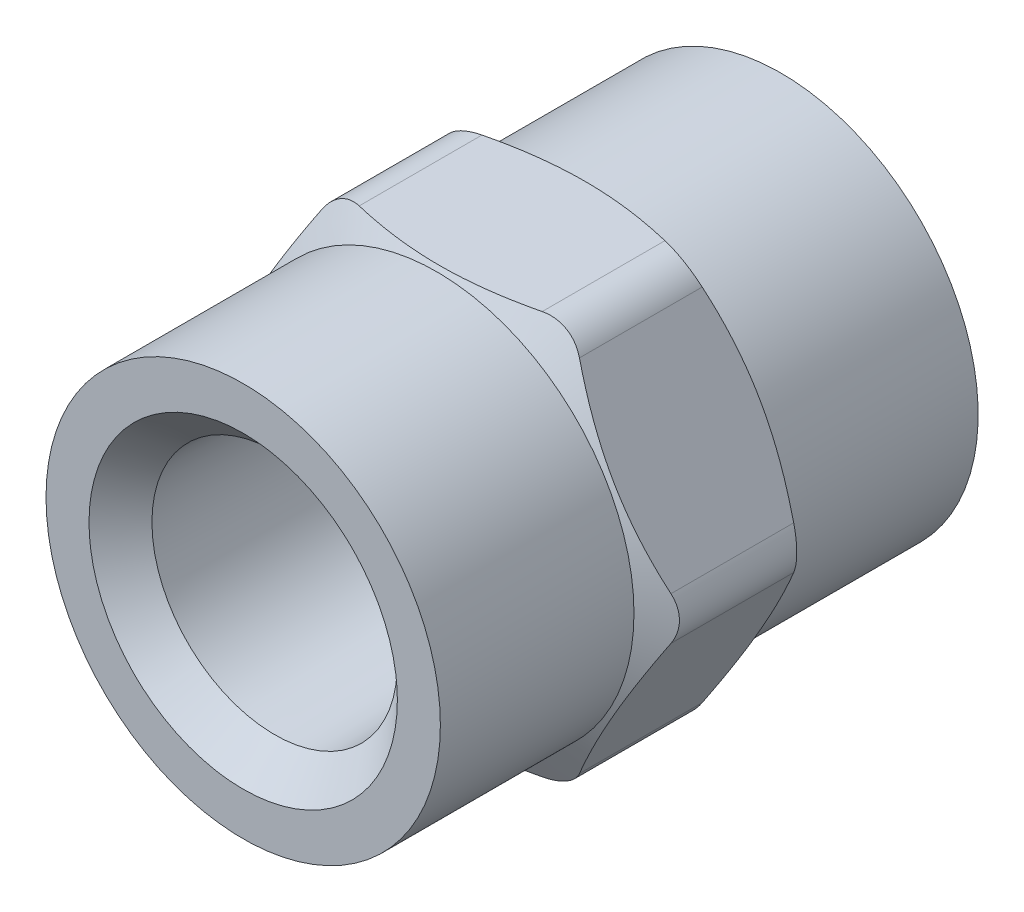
ISO-10303-21;
HEADER;
FILE_DESCRIPTION(('STEP AP214'),'2;1');
FILE_NAME('part.step','',(''),(''),'','','');
FILE_SCHEMA(('AUTOMOTIVE_DESIGN { 1 0 10303 214 1 1 1 1 }'));
ENDSEC;
DATA;
#1=APPLICATION_CONTEXT('core data for automotive mechanical design processes');
#2=APPLICATION_PROTOCOL_DEFINITION('international standard','automotive_design',2000,#1);
#3=PRODUCT_CONTEXT('',#1,'mechanical');
#4=PRODUCT('Part','Part','',(#3));
#5=PRODUCT_RELATED_PRODUCT_CATEGORY('part','',(#4));
#6=PRODUCT_DEFINITION_FORMATION('','',#4);
#7=PRODUCT_DEFINITION_CONTEXT('part definition',#1,'design');
#8=PRODUCT_DEFINITION('design','',#6,#7);
#9=PRODUCT_DEFINITION_SHAPE('','',#8);
#10=(LENGTH_UNIT() NAMED_UNIT(*) SI_UNIT(.MILLI.,.METRE.));
#11=(NAMED_UNIT(*) PLANE_ANGLE_UNIT() SI_UNIT($,.RADIAN.));
#12=(NAMED_UNIT(*) SI_UNIT($,.STERADIAN.) SOLID_ANGLE_UNIT());
#13=UNCERTAINTY_MEASURE_WITH_UNIT(LENGTH_MEASURE(1.E-05),#10,'distance_accuracy_value','');
#14=(GEOMETRIC_REPRESENTATION_CONTEXT(3) GLOBAL_UNCERTAINTY_ASSIGNED_CONTEXT((#13)) GLOBAL_UNIT_ASSIGNED_CONTEXT((#10,
#11,#12)) REPRESENTATION_CONTEXT('',''));
#15=CARTESIAN_POINT('',(0.,0.,0.));
#16=DIRECTION('',(0.,0.,1.));
#17=DIRECTION('',(1.,0.,0.));
#18=AXIS2_PLACEMENT_3D('',#15,#16,#17);
#19=CARTESIAN_POINT('',(0.,0.,19.0500000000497));
#20=DIRECTION('',(0.,0.,1.));
#21=DIRECTION('',(1.,0.,0.));
#22=AXIS2_PLACEMENT_3D('',#19,#20,#21);
#23=CONICAL_SURFACE('',#22,5.46100000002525,0.785398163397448);
#24=CARTESIAN_POINT('',(0.,0.,17.9358765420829));
#25=DIRECTION('',(0.,0.,1.));
#26=DIRECTION('',(-1.,0.,0.));
#27=AXIS2_PLACEMENT_3D('',#24,#25,#26);
#28=CIRCLE('',#27,4.34687654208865);
#29=CARTESIAN_POINT('',(-4.34687654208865,0.,17.935876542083));
#30=VERTEX_POINT('',#29);
#31=EDGE_CURVE('E179',#30,#30,#28,.F.);
#32=ORIENTED_EDGE('',*,*,#31,.T.);
#33=EDGE_LOOP('',(#32));
#34=FACE_BOUND('',#33,.T.);
#35=CARTESIAN_POINT('',(-5.461,0.,19.05));
#36=CARTESIAN_POINT('',(-5.461,0.500765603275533,19.05));
#37=CARTESIAN_POINT('',(-5.36983061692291,0.993700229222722,19.05));
#38=CARTESIAN_POINT('',(-5.27329562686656,1.5156456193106,19.05));
#39=CARTESIAN_POINT('',(-5.07757391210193,2.01016520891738,19.05));
#40=CARTESIAN_POINT('',(-4.87402680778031,2.52445679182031,19.05));
#41=CARTESIAN_POINT('',(-4.57083248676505,2.98831246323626,19.05));
#42=CARTESIAN_POINT('',(-4.26172184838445,3.46121948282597,19.05));
#43=CARTESIAN_POINT('',(-3.86151013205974,3.86151013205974,19.05));
#44=CARTESIAN_POINT('',(-3.46205578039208,4.26104326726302,19.05));
#45=CARTESIAN_POINT('',(-2.98831246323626,4.57083248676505,19.05));
#46=CARTESIAN_POINT('',(-2.52539384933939,4.87354323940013,19.05));
#47=CARTESIAN_POINT('',(-2.01016520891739,5.07757391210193,19.05));
#48=CARTESIAN_POINT('',(-1.5166545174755,5.2730042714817,19.05));
#49=CARTESIAN_POINT('',(-0.993700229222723,5.36983061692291,19.05));
#50=CARTESIAN_POINT('',(-0.501561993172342,5.46095129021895,19.05));
#51=CARTESIAN_POINT('',(0.,5.461,19.05));
#52=CARTESIAN_POINT('',(0.500502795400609,5.46104860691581,19.05));
#53=CARTESIAN_POINT('',(0.993700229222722,5.36983061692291,19.05));
#54=CARTESIAN_POINT('',(1.51564561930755,5.27329562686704,19.05));
#55=CARTESIAN_POINT('',(2.01016520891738,5.07757391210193,19.05));
#56=CARTESIAN_POINT('',(2.52445679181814,4.87402680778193,19.05));
#57=CARTESIAN_POINT('',(2.98831246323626,4.57083248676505,19.05));
#58=CARTESIAN_POINT('',(3.46121948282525,4.26172184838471,19.05));
#59=CARTESIAN_POINT('',(3.86151013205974,3.86151013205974,19.05));
#60=CARTESIAN_POINT('',(4.26104326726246,3.46205578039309,19.05));
#61=CARTESIAN_POINT('',(4.57083248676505,2.98831246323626,19.05));
#62=CARTESIAN_POINT('',(4.87354323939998,2.52539384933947,19.05));
#63=CARTESIAN_POINT('',(5.07757391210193,2.01016520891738,19.05));
#64=CARTESIAN_POINT('',(5.27300427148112,1.51665451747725,19.05));
#65=CARTESIAN_POINT('',(5.36983061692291,0.993700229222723,19.05));
#66=CARTESIAN_POINT('',(5.461,0.501298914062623,19.05));
#67=CARTESIAN_POINT('',(5.461,0.,19.05));
#68=B_SPLINE_CURVE_WITH_KNOTS('',2,(#35,#36,#37,#38,#39,#40,#41,#42,#43,#44,#45,#46,#47,#48,#49,
#50,#51,#52,#53,#54,#55,#56,#57,#58,#59,#60,#61,#62,#63,#64,#65,#66,#67),.UNSPECIFIED.,.F.,.F.,
(3,2,2,2,2,2,2,2,2,2,2,2,2,2,2,2,3),(0.,0.0625,0.125,0.1875,0.25,0.3125,0.375,0.4375,0.5,0.5625,
0.625,0.6875,0.75,0.8125,0.875,0.9375,1.),.UNSPECIFIED.);
#69=CARTESIAN_POINT('',(-5.46100000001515,0.,19.0500000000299));
#70=VERTEX_POINT('',#69);
#71=CARTESIAN_POINT('',(5.46100000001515,0.,19.0500000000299));
#72=VERTEX_POINT('',#71);
#73=EDGE_CURVE('E131',#70,#72,#68,.T.);
#74=ORIENTED_EDGE('',*,*,#73,.F.);
#75=CARTESIAN_POINT('',(5.461,0.,19.05));
#76=CARTESIAN_POINT('',(5.461,-0.500765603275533,19.05));
#77=CARTESIAN_POINT('',(5.36983061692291,-0.993700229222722,19.05));
#78=CARTESIAN_POINT('',(5.27329562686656,-1.5156456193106,19.05));
#79=CARTESIAN_POINT('',(5.07757391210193,-2.01016520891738,19.05));
#80=CARTESIAN_POINT('',(4.87402680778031,-2.52445679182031,19.05));
#81=CARTESIAN_POINT('',(4.57083248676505,-2.98831246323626,19.05));
#82=CARTESIAN_POINT('',(4.26172184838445,-3.46121948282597,19.05));
#83=CARTESIAN_POINT('',(3.86151013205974,-3.86151013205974,19.05));
#84=CARTESIAN_POINT('',(3.46205578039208,-4.26104326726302,19.05));
#85=CARTESIAN_POINT('',(2.98831246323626,-4.57083248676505,19.05));
#86=CARTESIAN_POINT('',(2.52539384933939,-4.87354323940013,19.05));
#87=CARTESIAN_POINT('',(2.01016520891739,-5.07757391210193,19.05));
#88=CARTESIAN_POINT('',(1.5166545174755,-5.2730042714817,19.05));
#89=CARTESIAN_POINT('',(0.993700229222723,-5.36983061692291,19.05));
#90=CARTESIAN_POINT('',(0.501561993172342,-5.46095129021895,19.05));
#91=CARTESIAN_POINT('',(0.,-5.461,19.05));
#92=CARTESIAN_POINT('',(-0.500502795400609,-5.46104860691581,19.05));
#93=CARTESIAN_POINT('',(-0.993700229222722,-5.36983061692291,19.05));
#94=CARTESIAN_POINT('',(-1.51564561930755,-5.27329562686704,19.05));
#95=CARTESIAN_POINT('',(-2.01016520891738,-5.07757391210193,19.05));
#96=CARTESIAN_POINT('',(-2.52445679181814,-4.87402680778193,19.05));
#97=CARTESIAN_POINT('',(-2.98831246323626,-4.57083248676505,19.05));
#98=CARTESIAN_POINT('',(-3.46121948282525,-4.26172184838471,19.05));
#99=CARTESIAN_POINT('',(-3.86151013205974,-3.86151013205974,19.05));
#100=CARTESIAN_POINT('',(-4.26104326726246,-3.46205578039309,19.05));
#101=CARTESIAN_POINT('',(-4.57083248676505,-2.98831246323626,19.05));
#102=CARTESIAN_POINT('',(-4.87354323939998,-2.52539384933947,19.05));
#103=CARTESIAN_POINT('',(-5.07757391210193,-2.01016520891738,19.05));
#104=CARTESIAN_POINT('',(-5.27300427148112,-1.51665451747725,19.05));
#105=CARTESIAN_POINT('',(-5.36983061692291,-0.993700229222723,19.05));
#106=CARTESIAN_POINT('',(-5.461,-0.501298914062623,19.05));
#107=CARTESIAN_POINT('',(-5.461,0.,19.05));
#108=B_SPLINE_CURVE_WITH_KNOTS('',2,(#75,#76,#77,#78,#79,#80,#81,#82,#83,#84,#85,#86,#87,#88,
#89,#90,#91,#92,#93,#94,#95,#96,#97,#98,#99,#100,#101,#102,#103,#104,#105,#106,#107),
.UNSPECIFIED.,.F.,.F.,(3,2,2,2,2,2,2,2,2,2,2,2,2,2,2,2,3),(0.,0.0625,0.125,0.1875,0.25,0.3125,
0.375,0.4375,0.5,0.5625,0.625,0.6875,0.75,0.8125,0.875,0.9375,1.),.UNSPECIFIED.);
#109=EDGE_CURVE('E128',#72,#70,#108,.T.);
#110=ORIENTED_EDGE('',*,*,#109,.F.);
#111=EDGE_LOOP('',(#74,#110));
#112=FACE_BOUND('',#111,.T.);
#113=ADVANCED_FACE('F16',(#34,#112),#23,.F.);
#114=CARTESIAN_POINT('',(0.,0.,19.05));
#115=DIRECTION('',(0.,0.,1.));
#116=DIRECTION('',(1.,0.,0.));
#117=AXIS2_PLACEMENT_3D('',#114,#115,#116);
#118=PLANE('',#117);
#119=ORIENTED_EDGE('',*,*,#73,.T.);
#120=ORIENTED_EDGE('',*,*,#109,.T.);
#121=EDGE_LOOP('',(#119,#120));
#122=FACE_BOUND('',#121,.T.);
#123=CARTESIAN_POINT('',(0.,0.,19.05));
#124=DIRECTION('',(0.,0.,-1.));
#125=DIRECTION('',(-1.,0.,0.));
#126=AXIS2_PLACEMENT_3D('',#123,#124,#125);
#127=CIRCLE('',#126,6.985);
#128=CARTESIAN_POINT('',(-6.985,0.,19.05));
#129=VERTEX_POINT('',#128);
#130=CARTESIAN_POINT('',(6.985,0.,19.05));
#131=VERTEX_POINT('',#130);
#132=EDGE_CURVE('E138',#129,#131,#127,.T.);
#133=ORIENTED_EDGE('',*,*,#132,.F.);
#134=CARTESIAN_POINT('',(0.,0.,19.05));
#135=DIRECTION('',(0.,0.,-1.));
#136=DIRECTION('',(1.,0.,0.));
#137=AXIS2_PLACEMENT_3D('',#134,#135,#136);
#138=CIRCLE('',#137,6.985);
#139=EDGE_CURVE('E176',#131,#129,#138,.T.);
#140=ORIENTED_EDGE('',*,*,#139,.F.);
#141=EDGE_LOOP('',(#133,#140));
#142=FACE_BOUND('',#141,.T.);
#143=ADVANCED_FACE('F136',(#122,#142),#118,.T.);
#144=CARTESIAN_POINT('',(0.,0.,17.9358765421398));
#145=DIRECTION('',(0.,0.,1.));
#146=DIRECTION('',(1.,0.,0.));
#147=AXIS2_PLACEMENT_3D('',#144,#145,#146);
#148=CONICAL_SURFACE('',#147,4.34687654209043,0.0310668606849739);
#149=ORIENTED_EDGE('',*,*,#31,.F.);
#150=EDGE_LOOP('',(#149));
#151=FACE_BOUND('',#150,.T.);
#152=CARTESIAN_POINT('',(0.,0.,12.1157936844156));
#153=DIRECTION('',(0.,0.,-1.));
#154=DIRECTION('',(1.,0.,0.));
#155=AXIS2_PLACEMENT_3D('',#152,#153,#154);
#156=CIRCLE('',#155,4.16600664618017);
#157=CARTESIAN_POINT('',(4.16580332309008,0.,12.1157968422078));
#158=VERTEX_POINT('',#157);
#159=CARTESIAN_POINT('',(-4.16580332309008,-2.13546404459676E-13,12.1157968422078));
#160=VERTEX_POINT('',#159);
#161=EDGE_CURVE('E957',#158,#160,#156,.T.);
#162=ORIENTED_EDGE('',*,*,#161,.T.);
#163=CARTESIAN_POINT('',(0.,0.,12.1157936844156));
#164=DIRECTION('',(0.,0.,-1.));
#165=DIRECTION('',(-1.,0.,0.));
#166=AXIS2_PLACEMENT_3D('',#163,#164,#165);
#167=CIRCLE('',#166,4.16600664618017);
#168=EDGE_CURVE('E375',#160,#158,#167,.T.);
#169=ORIENTED_EDGE('',*,*,#168,.T.);
#170=EDGE_LOOP('',(#162,#169));
#171=FACE_BOUND('',#170,.T.);
#172=ADVANCED_FACE('F156',(#151,#171),#148,.F.);
#173=CARTESIAN_POINT('',(0.,0.,19.18716));
#174=DIRECTION('',(0.,0.,-1.));
#175=DIRECTION('',(-1.,0.,0.));
#176=AXIS2_PLACEMENT_3D('',#173,#174,#175);
#177=CYLINDRICAL_SURFACE('',#176,6.985);
#178=CARTESIAN_POINT('',(0.,0.,12.192000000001));
#179=DIRECTION('',(0.,0.,-1.));
#180=DIRECTION('',(1.,0.,0.));
#181=AXIS2_PLACEMENT_3D('',#178,#179,#180);
#182=CIRCLE('',#181,6.9850000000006);
#183=CARTESIAN_POINT('',(6.9850000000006,0.,12.192000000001));
#184=VERTEX_POINT('',#183);
#185=EDGE_CURVE('E772',#184,#184,#182,.T.);
#186=ORIENTED_EDGE('',*,*,#185,.F.);
#187=EDGE_LOOP('',(#186));
#188=FACE_BOUND('',#187,.T.);
#189=ORIENTED_EDGE('',*,*,#139,.T.);
#190=ORIENTED_EDGE('',*,*,#132,.T.);
#191=EDGE_LOOP('',(#189,#190));
#192=FACE_BOUND('',#191,.T.);
#193=ADVANCED_FACE('F388',(#188,#192),#177,.T.);
#194=CARTESIAN_POINT('',(3.24089800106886,5.6134,11.7860546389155));
#195=DIRECTION('',(0.,0.,-1.));
#196=DIRECTION('',(-1.,0.,0.));
#197=AXIS2_PLACEMENT_3D('',#194,#195,#196);
#198=CYLINDRICAL_SURFACE('',#197,1.524);
#199=DIRECTION('',(0.,0.,1.));
#200=VECTOR('',#199,1.);
#201=CARTESIAN_POINT('',(3.24089800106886,7.1374,9.525));
#202=LINE('',#201,#200);
#203=CARTESIAN_POINT('',(3.24089800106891,7.1374000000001,11.6990909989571));
#204=VERTEX_POINT('',#203);
#205=CARTESIAN_POINT('',(3.24089800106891,7.1374000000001,7.35090900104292));
#206=VERTEX_POINT('',#205);
#207=EDGE_CURVE('E425',#204,#206,#202,.F.);
#208=ORIENTED_EDGE('',*,*,#207,.F.);
#209=CARTESIAN_POINT('',(4.56072071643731,6.37540000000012,11.6990909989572));
#210=CARTESIAN_POINT('',(4.552335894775,6.38992343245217,11.6950878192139));
#211=CARTESIAN_POINT('',(4.54370479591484,6.40433527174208,11.6911939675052));
#212=CARTESIAN_POINT('',(4.5260142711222,6.43281343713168,11.6836589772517));
#213=CARTESIAN_POINT('',(4.51695828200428,6.44688147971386,11.6800162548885));
#214=CARTESIAN_POINT('',(4.498423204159,6.47466612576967,11.6729834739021));
#215=CARTESIAN_POINT('',(4.48894716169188,6.48838439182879,11.6695919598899));
#216=CARTESIAN_POINT('',(4.46957780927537,6.51546351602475,11.6630614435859));
#217=CARTESIAN_POINT('',(4.45968714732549,6.5288259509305,11.659921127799));
#218=CARTESIAN_POINT('',(4.43949438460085,6.55518751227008,11.6538928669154));
#219=CARTESIAN_POINT('',(4.42919453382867,6.5681880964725,11.6510037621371));
#220=CARTESIAN_POINT('',(4.40818937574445,6.59382009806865,11.6454777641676));
#221=CARTESIAN_POINT('',(4.39748592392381,6.6064528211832,11.6428398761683));
#222=CARTESIAN_POINT('',(4.37567965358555,6.63134329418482,11.6378161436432));
#223=CARTESIAN_POINT('',(4.36457830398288,6.64360216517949,11.6354294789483));
#224=CARTESIAN_POINT('',(4.34198244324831,6.66773917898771,11.630908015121));
#225=CARTESIAN_POINT('',(4.33048902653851,6.67961822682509,11.6287725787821));
#226=CARTESIAN_POINT('',(4.30711534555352,6.70298989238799,11.6247533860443));
#227=CARTESIAN_POINT('',(4.29523581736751,6.7144831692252,11.622869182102));
#228=CARTESIAN_POINT('',(4.27109633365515,6.73707764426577,11.6193522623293));
#229=CARTESIAN_POINT('',(4.2588367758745,6.74817922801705,11.6177192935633));
#230=CARTESIAN_POINT('',(4.23394375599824,6.7699847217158,11.6147046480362));
#231=CARTESIAN_POINT('',(4.22131037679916,6.78068871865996,11.6133229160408));
#232=CARTESIAN_POINT('',(4.19567633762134,6.8016934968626,11.6108105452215));
#233=CARTESIAN_POINT('',(4.18267547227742,6.81199404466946,11.6096800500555));
#234=CARTESIAN_POINT('',(4.15631318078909,6.8321864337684,11.6076699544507));
#235=CARTESIAN_POINT('',(4.14295129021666,6.84207770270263,11.6067906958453));
#236=CARTESIAN_POINT('',(4.11587376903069,6.86144609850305,11.6052828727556));
#237=CARTESIAN_POINT('',(4.10215744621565,6.87092229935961,11.6046548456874));
#238=CARTESIAN_POINT('',(4.07437795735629,6.88945515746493,11.6036493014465));
#239=CARTESIAN_POINT('',(4.06031390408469,6.89851052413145,11.6032725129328));
#240=CARTESIAN_POINT('',(4.0318460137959,6.91619641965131,11.6027692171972));
#241=CARTESIAN_POINT('',(4.01744112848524,6.92482528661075,11.6026436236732));
#242=CARTESIAN_POINT('',(3.98836470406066,6.94161446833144,11.6026426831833));
#243=CARTESIAN_POINT('',(3.97369321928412,6.94977487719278,11.6027672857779));
#244=CARTESIAN_POINT('',(3.94414982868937,6.96558554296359,11.6032687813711));
#245=CARTESIAN_POINT('',(3.92927883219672,6.9732375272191,11.6036447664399));
#246=CARTESIAN_POINT('',(3.89934507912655,6.98802863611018,11.6046488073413));
#247=CARTESIAN_POINT('',(3.88428299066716,6.99516916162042,11.6052761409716));
#248=CARTESIAN_POINT('',(3.85397559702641,7.00893474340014,11.6067827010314));
#249=CARTESIAN_POINT('',(3.83873074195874,7.01556084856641,11.6076613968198));
#250=CARTESIAN_POINT('',(3.80806632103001,7.02829514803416,11.6096704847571));
#251=CARTESIAN_POINT('',(3.79264701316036,7.03440401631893,11.6108005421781));
#252=CARTESIAN_POINT('',(3.7616421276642,7.0461015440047,11.6133121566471));
#253=CARTESIAN_POINT('',(3.7460566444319,7.05169048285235,11.6146935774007));
#254=CARTESIAN_POINT('',(3.71472778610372,7.06234599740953,11.6177077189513));
#255=CARTESIAN_POINT('',(3.6989843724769,7.06741244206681,11.6193405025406));
#256=CARTESIAN_POINT('',(3.66734796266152,7.07702095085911,11.6228571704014));
#257=CARTESIAN_POINT('',(3.6514548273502,7.08156246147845,11.6247413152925));
#258=CARTESIAN_POINT('',(3.61952721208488,7.09011921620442,11.6287605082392));
#259=CARTESIAN_POINT('',(3.60349252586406,7.09413347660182,11.630896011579));
#260=CARTESIAN_POINT('',(3.57128997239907,7.10163397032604,11.6354177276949));
#261=CARTESIAN_POINT('',(3.55512186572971,7.1051187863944,11.6378045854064));
#262=CARTESIAN_POINT('',(3.52266055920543,7.11155874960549,11.6428288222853));
#263=CARTESIAN_POINT('',(3.50636712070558,7.11451204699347,11.6454670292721));
#264=CARTESIAN_POINT('',(3.47366315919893,7.1198874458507,11.6509937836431));
#265=CARTESIAN_POINT('',(3.45725243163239,7.12230727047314,11.6538833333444));
#266=CARTESIAN_POINT('',(3.42432182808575,7.12661429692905,11.6599126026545));
#267=CARTESIAN_POINT('',(3.40780181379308,7.1284988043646,11.6630534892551));
#268=CARTESIAN_POINT('',(3.37466047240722,7.13173389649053,11.6695852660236));
#269=CARTESIAN_POINT('',(3.35803910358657,7.13308138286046,11.6729774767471));
#270=CARTESIAN_POINT('',(3.32470289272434,7.13524113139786,11.6800117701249));
#271=CARTESIAN_POINT('',(3.30798813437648,7.13604990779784,11.683655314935));
#272=CARTESIAN_POINT('',(3.27447259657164,7.1371313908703,11.6911920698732));
#273=CARTESIAN_POINT('',(3.25767204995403,7.13740024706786,11.6950868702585));
#274=CARTESIAN_POINT('',(3.24089800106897,7.13740000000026,11.6990909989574));
#275=B_SPLINE_CURVE_WITH_KNOTS('',3,(#209,#210,#211,#212,#213,#214,#215,#216,#217,#218,#219,
#220,#221,#222,#223,#224,#225,#226,#227,#228,#229,#230,#231,#232,#233,#234,#235,#236,#237,#238,
#239,#240,#241,#242,#243,#244,#245,#246,#247,#248,#249,#250,#251,#252,#253,#254,#255,#256,#257,
#258,#259,#260,#261,#262,#263,#264,#265,#266,#267,#268,#269,#270,#271,#272,#273,#274),
.UNSPECIFIED.,.F.,.F.,(4,2,2,2,2,2,2,2,2,2,2,2,2,2,2,2,2,2,2,2,2,2,2,2,2,2,2,2,2,2,2,2,4),(0.,
0.0517218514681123,0.103080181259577,0.154112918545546,0.204858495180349,0.255355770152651,
0.30564394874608,0.355762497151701,0.405751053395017,0.455649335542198,0.505497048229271,
0.555333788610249,0.605198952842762,0.655131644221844,0.705170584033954,0.755354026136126,
0.805719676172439,0.856075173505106,0.906249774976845,0.956281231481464,1.00620783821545,
1.05606835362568,1.1059019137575,1.15574794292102,1.20564606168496,1.25563599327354,
1.305757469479,1.35605013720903,1.40655346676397,1.45730666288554,1.50834857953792,
1.55971763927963,1.61145175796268),.UNSPECIFIED.);
#276=CARTESIAN_POINT('',(4.56072071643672,6.37539999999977,11.6990909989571));
#277=VERTEX_POINT('',#276);
#278=EDGE_CURVE('E180',#277,#204,#275,.T.);
#279=ORIENTED_EDGE('',*,*,#278,.F.);
#280=DIRECTION('',(0.,0.,1.));
#281=VECTOR('',#280,1.);
#282=CARTESIAN_POINT('',(4.56072071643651,6.3753999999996,9.525));
#283=LINE('',#282,#281);
#284=CARTESIAN_POINT('',(4.56072071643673,6.37539999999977,7.35090900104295));
#285=VERTEX_POINT('',#284);
#286=EDGE_CURVE('E422',#285,#277,#283,.T.);
#287=ORIENTED_EDGE('',*,*,#286,.F.);
#288=CARTESIAN_POINT('',(4.56072071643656,6.37539999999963,7.35090900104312));
#289=CARTESIAN_POINT('',(4.5523238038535,6.38994421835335,7.35491784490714));
#290=CARTESIAN_POINT('',(4.54367234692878,6.40437344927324,7.35881138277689));
#291=CARTESIAN_POINT('',(4.52590887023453,6.43291457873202,7.36634621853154));
#292=CARTESIAN_POINT('',(4.5167991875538,6.44702764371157,7.36998860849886));
#293=CARTESIAN_POINT('',(4.49813131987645,6.47492237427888,7.37702116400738));
#294=CARTESIAN_POINT('',(4.48857533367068,6.48870524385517,7.38041238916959));
#295=CARTESIAN_POINT('',(4.46902760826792,6.51592601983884,7.38694265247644));
#296=CARTESIAN_POINT('',(4.45903792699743,6.52936515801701,7.39008271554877));
#297=CARTESIAN_POINT('',(4.43863587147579,6.55588540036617,7.39611068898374));
#298=CARTESIAN_POINT('',(4.42822541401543,6.56896775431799,7.39899958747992));
#299=CARTESIAN_POINT('',(4.40699525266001,6.59476186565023,7.40452526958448));
#300=CARTESIAN_POINT('',(4.39617732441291,6.60747488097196,7.40716300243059));
#301=CARTESIAN_POINT('',(4.37414600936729,6.63251826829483,7.41218639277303));
#302=CARTESIAN_POINT('',(4.36293425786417,6.64484989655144,7.41457295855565));
#303=CARTESIAN_POINT('',(4.34012941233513,6.66911898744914,7.41909405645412));
#304=CARTESIAN_POINT('',(4.32853781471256,6.68105769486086,7.4212294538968));
#305=CARTESIAN_POINT('',(4.30498769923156,6.70452995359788,7.42524825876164));
#306=CARTESIAN_POINT('',(4.29303054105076,6.71606472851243,7.42713248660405));
#307=CARTESIAN_POINT('',(4.26876401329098,6.73871867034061,7.4306489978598));
#308=CARTESIAN_POINT('',(4.25645586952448,6.7498390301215,7.43228205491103));
#309=CARTESIAN_POINT('',(4.23150234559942,6.77165423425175,7.43529627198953));
#310=CARTESIAN_POINT('',(4.21885806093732,6.78235023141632,7.43667815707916));
#311=CARTESIAN_POINT('',(4.19324747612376,6.80330735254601,7.43919007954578));
#312=CARTESIAN_POINT('',(4.18028214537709,6.81356958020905,7.44032079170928));
#313=CARTESIAN_POINT('',(4.15404491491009,6.83365035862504,7.44233041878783));
#314=CARTESIAN_POINT('',(4.14077386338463,6.84346995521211,7.44320995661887));
#315=CARTESIAN_POINT('',(4.11394084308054,6.86265722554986,7.44471728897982));
#316=CARTESIAN_POINT('',(4.10037960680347,6.87202587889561,7.44534565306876));
#317=CARTESIAN_POINT('',(4.0729820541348,6.89030357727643,7.44635068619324));
#318=CARTESIAN_POINT('',(4.05914636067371,6.89921352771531,7.44672787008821));
#319=CARTESIAN_POINT('',(4.03121589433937,6.91656669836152,7.44723061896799));
#320=CARTESIAN_POINT('',(4.01712164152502,6.92501074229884,7.44735664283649));
#321=CARTESIAN_POINT('',(3.98866924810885,6.94143764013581,7.44735705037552));
#322=CARTESIAN_POINT('',(3.97431114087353,6.94942055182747,7.44723146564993));
#323=CARTESIAN_POINT('',(3.94532101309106,6.96493060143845,7.44672951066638));
#324=CARTESIAN_POINT('',(3.93068853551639,6.9724568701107,7.44635267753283));
#325=CARTESIAN_POINT('',(3.90116385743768,6.98704357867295,7.44534830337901));
#326=CARTESIAN_POINT('',(3.88627118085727,6.9941030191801,7.44472024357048));
#327=CARTESIAN_POINT('',(3.85624068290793,7.00774644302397,7.44321346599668));
#328=CARTESIAN_POINT('',(3.84110237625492,7.01432929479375,7.44233417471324));
#329=CARTESIAN_POINT('',(3.81059557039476,7.02701035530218,7.44032498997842));
#330=CARTESIAN_POINT('',(3.79522658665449,7.03310729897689,7.43919446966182));
#331=CARTESIAN_POINT('',(3.76427374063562,7.04480781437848,7.43668287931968));
#332=CARTESIAN_POINT('',(3.74868940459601,7.05040998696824,7.43530113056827));
#333=CARTESIAN_POINT('',(3.71732151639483,7.06111270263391,7.43228713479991));
#334=CARTESIAN_POINT('',(3.70153751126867,7.06621171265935,7.43065415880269));
#335=CARTESIAN_POINT('',(3.66978628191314,7.07590033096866,7.4271377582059));
#336=CARTESIAN_POINT('',(3.65381863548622,7.0804882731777,7.42525355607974));
#337=CARTESIAN_POINT('',(3.6217164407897,7.08914748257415,7.42123475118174));
#338=CARTESIAN_POINT('',(3.6055815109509,7.09321695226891,7.41909932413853));
#339=CARTESIAN_POINT('',(3.57316137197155,7.10083245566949,7.41457811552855));
#340=CARTESIAN_POINT('',(3.55687583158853,7.10437656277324,7.41219146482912));
#341=CARTESIAN_POINT('',(3.52417138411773,7.11093510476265,7.40716785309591));
#342=CARTESIAN_POINT('',(3.50775220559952,7.11394748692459,7.40452998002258));
#343=CARTESIAN_POINT('',(3.47479766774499,7.119436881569,7.39900396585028));
#344=CARTESIAN_POINT('',(3.45826210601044,7.12191171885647,7.39611487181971));
#345=CARTESIAN_POINT('',(3.42509224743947,7.1263208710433,7.39008645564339));
#346=CARTESIAN_POINT('',(3.4084578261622,7.12825289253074,7.3869461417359));
#347=CARTESIAN_POINT('',(3.37510792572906,7.13157183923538,7.38041532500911));
#348=CARTESIAN_POINT('',(3.35839240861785,7.13295635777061,7.37702379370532));
#349=CARTESIAN_POINT('',(3.32489825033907,7.1351762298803,7.36999057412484));
#350=CARTESIAN_POINT('',(3.30811966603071,7.13600906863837,7.36634782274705));
#351=CARTESIAN_POINT('',(3.27451738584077,7.13712234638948,7.35881221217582));
#352=CARTESIAN_POINT('',(3.25769384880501,7.13740016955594,7.3549182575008));
#353=CARTESIAN_POINT('',(3.24089800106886,7.1374,7.35090900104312));
#354=B_SPLINE_CURVE_WITH_KNOTS('',3,(#288,#289,#290,#291,#292,#293,#294,#295,#296,#297,#298,
#299,#300,#301,#302,#303,#304,#305,#306,#307,#308,#309,#310,#311,#312,#313,#314,#315,#316,#317,
#318,#319,#320,#321,#322,#323,#324,#325,#326,#327,#328,#329,#330,#331,#332,#333,#334,#335,#336,
#337,#338,#339,#340,#341,#342,#343,#344,#345,#346,#347,#348,#349,#350,#351,#352,#353),
.UNSPECIFIED.,.F.,.F.,(4,2,2,2,2,2,2,2,2,2,2,2,2,2,2,2,2,2,2,2,2,2,2,2,2,2,2,2,2,2,2,2,4),(0.,
0.0517954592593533,0.10334926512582,0.154671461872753,0.205772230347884,0.256661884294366,
0.307350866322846,0.357849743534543,0.408169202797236,0.458320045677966,0.508313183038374,
0.558159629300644,0.607870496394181,0.657456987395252,0.706930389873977,0.756302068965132,
0.805583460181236,0.854858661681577,0.904224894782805,0.953693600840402,1.00327615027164,
1.05298383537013,1.10282786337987,1.15281934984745,1.20296931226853,1.25328866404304,
1.30378820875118,1.35447863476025,1.40537051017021,1.45647427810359,1.50780025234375,
1.55935861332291,1.61115940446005),.UNSPECIFIED.);
#355=EDGE_CURVE('E178',#285,#206,#354,.T.);
#356=ORIENTED_EDGE('',*,*,#355,.T.);
#357=EDGE_LOOP('',(#208,#279,#287,#356));
#358=FACE_BOUND('',#357,.T.);
#359=ADVANCED_FACE('F396',(#358),#198,.T.);
#360=CARTESIAN_POINT('',(-3.24089800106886,5.6134,11.7860546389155));
#361=DIRECTION('',(0.,0.,-1.));
#362=DIRECTION('',(-1.,0.,0.));
#363=AXIS2_PLACEMENT_3D('',#360,#361,#362);
#364=CYLINDRICAL_SURFACE('',#363,1.52400000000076);
#365=DIRECTION('',(0.,0.,1.));
#366=VECTOR('',#365,1.);
#367=CARTESIAN_POINT('',(-4.56072071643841,6.3754000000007,9.525));
#368=LINE('',#367,#366);
#369=CARTESIAN_POINT('',(-4.56072071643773,6.37540000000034,7.35090900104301));
#370=VERTEX_POINT('',#369);
#371=CARTESIAN_POINT('',(-4.56072071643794,6.37540000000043,11.6990909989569));
#372=VERTEX_POINT('',#371);
#373=EDGE_CURVE('E562',#370,#372,#368,.T.);
#374=ORIENTED_EDGE('',*,*,#373,.T.);
#375=CARTESIAN_POINT('',(-4.56072071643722,6.37540000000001,11.6990909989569));
#376=CARTESIAN_POINT('',(-4.55232380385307,6.38994421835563,11.6950821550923));
#377=CARTESIAN_POINT('',(-4.54367234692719,6.40437344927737,11.6911886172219));
#378=CARTESIAN_POINT('',(-4.52590887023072,6.43291457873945,11.6836537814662));
#379=CARTESIAN_POINT('',(-4.51679918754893,6.44702764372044,11.6800113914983));
#380=CARTESIAN_POINT('',(-4.4981313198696,6.47492237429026,11.6729788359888));
#381=CARTESIAN_POINT('',(-4.48857533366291,6.4887052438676,11.6695876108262));
#382=CARTESIAN_POINT('',(-4.46902760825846,6.51592601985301,11.6630573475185));
#383=CARTESIAN_POINT('',(-4.45903792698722,6.52936515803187,11.6599172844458));
#384=CARTESIAN_POINT('',(-4.43863587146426,6.55588540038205,11.6538893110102));
#385=CARTESIAN_POINT('',(-4.42822541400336,6.56896775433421,11.6510004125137));
#386=CARTESIAN_POINT('',(-4.40699525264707,6.59476186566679,11.6454747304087));
#387=CARTESIAN_POINT('',(-4.39617732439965,6.60747488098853,11.6428369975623));
#388=CARTESIAN_POINT('',(-4.37414600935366,6.63251826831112,11.6378136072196));
#389=CARTESIAN_POINT('',(-4.3629342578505,6.64484989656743,11.6354270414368));
#390=CARTESIAN_POINT('',(-4.34012941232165,6.66911898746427,11.6309059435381));
#391=CARTESIAN_POINT('',(-4.32853781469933,6.68105769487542,11.6287705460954));
#392=CARTESIAN_POINT('',(-4.30498769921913,6.70452995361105,11.6247517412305));
#393=CARTESIAN_POINT('',(-4.2930305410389,6.71606472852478,11.6228675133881));
#394=CARTESIAN_POINT('',(-4.26876401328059,6.73871867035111,11.6193510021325));
#395=CARTESIAN_POINT('',(-4.256455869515,6.74983903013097,11.6177179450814));
#396=CARTESIAN_POINT('',(-4.23150234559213,6.77165423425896,11.6147037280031));
#397=CARTESIAN_POINT('',(-4.21885806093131,6.78235023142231,11.6133218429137));
#398=CARTESIAN_POINT('',(-4.19324747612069,6.80330735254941,11.6108099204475));
#399=CARTESIAN_POINT('',(-4.18028214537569,6.81356958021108,11.6096792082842));
#400=CARTESIAN_POINT('',(-4.15404491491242,6.83365035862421,11.6076695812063));
#401=CARTESIAN_POINT('',(-4.14077386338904,6.84346995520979,11.6067900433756));
#402=CARTESIAN_POINT('',(-4.11394084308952,6.86265722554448,11.6052827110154));
#403=CARTESIAN_POINT('',(-4.10037960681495,6.87202587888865,11.6046543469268));
#404=CARTESIAN_POINT('',(-4.0729820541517,6.89030357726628,11.6036493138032));
#405=CARTESIAN_POINT('',(-4.05914636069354,6.89921352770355,11.6032721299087));
#406=CARTESIAN_POINT('',(-4.03121589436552,6.9165666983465,11.60276938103));
#407=CARTESIAN_POINT('',(-4.01712164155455,6.9250107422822,11.6026433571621));
#408=CARTESIAN_POINT('',(-3.98866924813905,6.94143764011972,11.6026429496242));
#409=CARTESIAN_POINT('',(-3.97431114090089,6.94942055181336,11.6027685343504));
#410=CARTESIAN_POINT('',(-3.94532101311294,6.96493060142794,11.603270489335));
#411=CARTESIAN_POINT('',(-3.93068853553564,6.97245687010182,11.603647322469));
#412=CARTESIAN_POINT('',(-3.90116385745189,6.987043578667,11.6046516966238));
#413=CARTESIAN_POINT('',(-3.88627118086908,6.99410301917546,11.6052797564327));
#414=CARTESIAN_POINT('',(-3.85624068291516,7.00774644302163,11.6067865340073));
#415=CARTESIAN_POINT('',(-3.84110237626,7.01432929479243,11.607665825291));
#416=CARTESIAN_POINT('',(-3.8105955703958,7.02701035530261,11.6096750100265));
#417=CARTESIAN_POINT('',(-3.79522658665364,7.03310729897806,11.6108055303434));
#418=CARTESIAN_POINT('',(-3.76427374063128,7.04480781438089,11.613317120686));
#419=CARTESIAN_POINT('',(-3.74868940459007,7.05040998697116,11.6146988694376));
#420=CARTESIAN_POINT('',(-3.717321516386,7.06111270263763,11.6177128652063));
#421=CARTESIAN_POINT('',(-3.70153751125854,7.06621171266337,11.6193458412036));
#422=CARTESIAN_POINT('',(-3.66978628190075,7.0759003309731,11.6228622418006));
#423=CARTESIAN_POINT('',(-3.65381863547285,7.08048827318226,11.6247464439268));
#424=CARTESIAN_POINT('',(-3.62171644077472,7.08914748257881,11.6287652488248));
#425=CARTESIAN_POINT('',(-3.60558151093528,7.09321695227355,11.630900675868));
#426=CARTESIAN_POINT('',(-3.57316137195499,7.10083245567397,11.6354218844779));
#427=CARTESIAN_POINT('',(-3.55687583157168,7.1043765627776,11.6378085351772));
#428=CARTESIAN_POINT('',(-3.52417138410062,7.11093510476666,11.6428321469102));
#429=CARTESIAN_POINT('',(-3.50775220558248,7.11394748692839,11.6454700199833));
#430=CARTESIAN_POINT('',(-3.4747976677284,7.11943688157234,11.6509960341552));
#431=CARTESIAN_POINT('',(-3.45826210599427,7.12191171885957,11.6538851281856));
#432=CARTESIAN_POINT('',(-3.42509224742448,7.12632087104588,11.6599135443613));
#433=CARTESIAN_POINT('',(-3.40845782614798,7.12825289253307,11.6630538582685));
#434=CARTESIAN_POINT('',(-3.37510792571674,7.13157183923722,11.6695846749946));
#435=CARTESIAN_POINT('',(-3.35839240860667,7.13295635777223,11.672976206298));
#436=CARTESIAN_POINT('',(-3.32489825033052,7.13517622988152,11.6800094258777));
#437=CARTESIAN_POINT('',(-3.30811966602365,7.13600906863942,11.683652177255));
#438=CARTESIAN_POINT('',(-3.27451738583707,7.1371223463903,11.6911877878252));
#439=CARTESIAN_POINT('',(-3.25769384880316,7.1374001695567,11.6950817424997));
#440=CARTESIAN_POINT('',(-3.24089800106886,7.13740000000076,11.6990909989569));
#441=B_SPLINE_CURVE_WITH_KNOTS('',3,(#375,#376,#377,#378,#379,#380,#381,#382,#383,#384,#385,
#386,#387,#388,#389,#390,#391,#392,#393,#394,#395,#396,#397,#398,#399,#400,#401,#402,#403,#404,
#405,#406,#407,#408,#409,#410,#411,#412,#413,#414,#415,#416,#417,#418,#419,#420,#421,#422,#423,
#424,#425,#426,#427,#428,#429,#430,#431,#432,#433,#434,#435,#436,#437,#438,#439,#440),
.UNSPECIFIED.,.F.,.F.,(4,2,2,2,2,2,2,2,2,2,2,2,2,2,2,2,2,2,2,2,2,2,2,2,2,2,2,2,2,2,2,2,4),(0.,
0.0517954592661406,0.103349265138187,0.154671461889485,0.205772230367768,0.256661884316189,
0.307350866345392,0.357849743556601,0.408169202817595,0.458320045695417,0.508313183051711,
0.558159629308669,0.607870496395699,0.657456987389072,0.706930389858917,0.756302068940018,
0.805583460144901,0.854858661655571,0.904224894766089,0.953693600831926,1.00327615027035,
1.05298383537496,1.10282786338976,1.15281934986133,1.20296931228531,1.25328866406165,
1.30378820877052,1.35447863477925,1.40537051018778,1.45647427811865,1.5078002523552,
1.55935861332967,1.61115940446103),.UNSPECIFIED.);
#442=CARTESIAN_POINT('',(-3.24089800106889,7.13740000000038,11.699090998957));
#443=VERTEX_POINT('',#442);
#444=EDGE_CURVE('E582',#372,#443,#441,.T.);
#445=ORIENTED_EDGE('',*,*,#444,.T.);
#446=DIRECTION('',(0.,0.,1.));
#447=VECTOR('',#446,1.);
#448=CARTESIAN_POINT('',(-3.24089800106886,7.1374,9.525));
#449=LINE('',#448,#447);
#450=CARTESIAN_POINT('',(-3.24089800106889,7.13740000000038,7.35090900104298));
#451=VERTEX_POINT('',#450);
#452=EDGE_CURVE('E467',#451,#443,#449,.T.);
#453=ORIENTED_EDGE('',*,*,#452,.F.);
#454=CARTESIAN_POINT('',(-3.24089800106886,7.13740000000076,7.35090900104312));
#455=CARTESIAN_POINT('',(-3.25769211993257,7.13740016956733,7.35491784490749));
#456=CARTESIAN_POINT('',(-3.27451392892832,7.13712240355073,7.35881138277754));
#457=CARTESIAN_POINT('',(-3.3081130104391,7.13600934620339,7.36634621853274));
#458=CARTESIAN_POINT('',(-3.32489012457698,7.13517666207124,7.36998860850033));
#459=CARTESIAN_POINT('',(-3.3583816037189,7.13295717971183,7.37702116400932));
#460=CARTESIAN_POINT('',(-3.37509591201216,7.13157288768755,7.38041238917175));
#461=CARTESIAN_POINT('',(-3.40844365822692,7.1282544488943,7.386942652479));
#462=CARTESIAN_POINT('',(-3.42507713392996,7.12632270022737,7.39008271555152));
#463=CARTESIAN_POINT('',(-3.45824536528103,7.12191412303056,7.39611068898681));
#464=CARTESIAN_POINT('',(-3.4747802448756,7.11943957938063,7.39899958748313));
#465=CARTESIAN_POINT('',(-3.50773368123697,7.11395077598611,7.40452526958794));
#466=CARTESIAN_POINT('',(-3.52415243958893,7.1109386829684,7.40716300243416));
#467=CARTESIAN_POINT('',(-3.55685630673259,7.1043806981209,7.41218639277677));
#468=CARTESIAN_POINT('',(-3.57314168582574,7.10083685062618,7.41457295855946));
#469=CARTESIAN_POINT('',(-3.60556175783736,7.09322182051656,7.41909405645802));
#470=CARTESIAN_POINT('',(-3.62169678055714,7.08915255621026,7.42122945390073));
#471=CARTESIAN_POINT('',(-3.65379941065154,7.08049368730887,7.42524825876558));
#472=CARTESIAN_POINT('',(-3.66976739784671,7.07590587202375,7.42713248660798));
#473=CARTESIAN_POINT('',(-3.70151955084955,7.06621741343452,7.43064899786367));
#474=CARTESIAN_POINT('',(-3.71730413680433,7.06111842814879,7.43228205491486));
#475=CARTESIAN_POINT('',(-3.74867341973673,7.05041564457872,7.43529627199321));
#476=CARTESIAN_POINT('',(-3.76425856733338,7.04481337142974,7.43667815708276));
#477=CARTESIAN_POINT('',(-3.79521325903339,7.03311251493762,7.43919007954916));
#478=CARTESIAN_POINT('',(-3.8105832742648,7.02701532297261,7.44032079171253));
#479=CARTESIAN_POINT('',(-3.84109235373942,7.01433360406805,7.44233041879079));
#480=CARTESIAN_POINT('',(-3.8562318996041,7.00775033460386,7.44320995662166));
#481=CARTESIAN_POINT('',(-3.88626507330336,6.99410589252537,7.44471728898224));
#482=CARTESIAN_POINT('',(-3.90115918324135,6.98704584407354,7.44534565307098));
#483=CARTESIAN_POINT('',(-3.93068691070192,6.97245771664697,7.44635068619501));
#484=CARTESIAN_POINT('',(-3.94532100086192,6.96493062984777,7.44672787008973));
#485=CARTESIAN_POINT('',(-3.97431452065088,6.94941872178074,7.447230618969));
#486=CARTESIAN_POINT('',(-3.98867440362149,6.94143476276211,7.44735664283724));
#487=CARTESIAN_POINT('',(-4.01712671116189,6.92500771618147,7.44735705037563));
#488=CARTESIAN_POINT('',(-4.03121916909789,6.91656468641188,7.44723146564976));
#489=CARTESIAN_POINT('',(-4.05914632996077,6.89921352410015,7.4467295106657));
#490=CARTESIAN_POINT('',(-4.07298050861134,6.89030456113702,7.4463526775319));
#491=CARTESIAN_POINT('',(-4.10037530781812,6.87202879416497,7.44534830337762));
#492=CARTESIAN_POINT('',(-4.11393530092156,6.86266107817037,7.44472024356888));
#493=CARTESIAN_POINT('',(-4.14076610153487,6.84347561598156,7.44321346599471));
#494=CARTESIAN_POINT('',(-4.15403617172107,6.83365688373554,7.44233417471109));
#495=CARTESIAN_POINT('',(-4.18027169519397,6.81357774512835,7.44032498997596));
#496=CARTESIAN_POINT('',(-4.19323629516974,6.80331628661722,7.43919446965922));
#497=CARTESIAN_POINT('',(-4.21884566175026,6.78236059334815,7.43668287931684));
#498=CARTESIAN_POINT('',(-4.23148945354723,6.77166524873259,7.43530113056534));
#499=CARTESIAN_POINT('',(-4.25644222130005,6.74985121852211,7.43228713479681));
#500=CARTESIAN_POINT('',(-4.26875009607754,6.73873137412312,7.43065415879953));
#501=CARTESIAN_POINT('',(-4.29301630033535,6.71607831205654,7.42713775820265));
#502=CARTESIAN_POINT('',(-4.30497339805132,6.70454389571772,7.42525355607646));
#503=CARTESIAN_POINT('',(-4.32852359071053,6.68107218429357,7.42123475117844));
#504=CARTESIAN_POINT('',(-4.34011531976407,6.66913366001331,7.41909932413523));
#505=CARTESIAN_POINT('',(-4.36292060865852,6.64486474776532,7.41457811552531));
#506=CARTESIAN_POINT('',(-4.37413266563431,6.63253310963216,7.41219146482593));
#507=CARTESIAN_POINT('',(-4.3961647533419,6.60748949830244,7.40716785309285));
#508=CARTESIAN_POINT('',(-4.40698314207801,6.59477626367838,7.4045299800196));
#509=CARTESIAN_POINT('',(-4.4282143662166,6.56898149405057,7.3990039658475));
#510=CARTESIAN_POINT('',(-4.43862541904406,6.55589869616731,7.39611487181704));
#511=CARTESIAN_POINT('',(-4.45902878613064,6.52937733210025,7.390086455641));
#512=CARTESIAN_POINT('',(-4.4690191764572,6.51593751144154,7.38694614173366));
#513=CARTESIAN_POINT('',(-4.48856841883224,6.4887151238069,7.38041532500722));
#514=CARTESIAN_POINT('',(-4.49812520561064,6.4749313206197,7.37702379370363));
#515=CARTESIAN_POINT('',(-4.51679475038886,6.44703446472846,7.36999057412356));
#516=CARTESIAN_POINT('',(-4.52590530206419,6.43292020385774,7.366347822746));
#517=CARTESIAN_POINT('',(-4.54367056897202,6.40437641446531,7.35881221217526));
#518=CARTESIAN_POINT('',(-4.55232293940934,6.38994571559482,7.35491825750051));
#519=CARTESIAN_POINT('',(-4.56072071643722,6.37540000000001,7.35090900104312));
#520=B_SPLINE_CURVE_WITH_KNOTS('',3,(#454,#455,#456,#457,#458,#459,#460,#461,#462,#463,#464,
#465,#466,#467,#468,#469,#470,#471,#472,#473,#474,#475,#476,#477,#478,#479,#480,#481,#482,#483,
#484,#485,#486,#487,#488,#489,#490,#491,#492,#493,#494,#495,#496,#497,#498,#499,#500,#501,#502,
#503,#504,#505,#506,#507,#508,#509,#510,#511,#512,#513,#514,#515,#516,#517,#518,#519),
.UNSPECIFIED.,.F.,.F.,(4,2,2,2,2,2,2,2,2,2,2,2,2,2,2,2,2,2,2,2,2,2,2,2,2,2,2,2,2,2,2,2,4),(0.,
0.0517954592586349,0.103349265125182,0.154671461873,0.205772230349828,0.256661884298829,
0.307350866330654,0.35784974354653,0.408169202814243,0.458320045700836,0.508313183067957,
0.558159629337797,0.607870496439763,0.657456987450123,0.706930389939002,0.75630206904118,
0.805583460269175,0.854858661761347,0.904224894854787,0.95369360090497,1.00327615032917,
1.05298383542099,1.10282786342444,1.15281934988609,1.20296931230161,1.25328866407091,
1.3037882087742,1.35447863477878,1.40537051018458,1.45647427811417,1.50780025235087,
1.55935861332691,1.61115940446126),.UNSPECIFIED.);
#521=EDGE_CURVE('E430',#451,#370,#520,.T.);
#522=ORIENTED_EDGE('',*,*,#521,.T.);
#523=EDGE_LOOP('',(#374,#445,#453,#522));
#524=FACE_BOUND('',#523,.T.);
#525=ADVANCED_FACE('F348',(#524),#364,.T.);
#526=CARTESIAN_POINT('',(0.,0.,6.830568));
#527=DIRECTION('',(0.,0.,1.));
#528=DIRECTION('',(1.,0.,0.));
#529=AXIS2_PLACEMENT_3D('',#526,#527,#528);
#530=CYLINDRICAL_SURFACE('',#529,4.1656);
#531=CARTESIAN_POINT('',(0.,0.,6.9342));
#532=DIRECTION('',(0.,0.,-1.));
#533=DIRECTION('',(1.,0.,0.));
#534=AXIS2_PLACEMENT_3D('',#531,#532,#533);
#535=CIRCLE('',#534,4.1656);
#536=CARTESIAN_POINT('',(4.16580338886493,0.,6.93420157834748));
#537=VERTEX_POINT('',#536);
#538=CARTESIAN_POINT('',(-4.16580338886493,-2.13826542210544E-13,6.93420157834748));
#539=VERTEX_POINT('',#538);
#540=EDGE_CURVE('E331',#537,#539,#535,.T.);
#541=ORIENTED_EDGE('',*,*,#540,.T.);
#542=CARTESIAN_POINT('',(0.,0.,6.9342));
#543=DIRECTION('',(0.,0.,-1.));
#544=DIRECTION('',(-1.,-1.020180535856E-13,0.));
#545=AXIS2_PLACEMENT_3D('',#542,#543,#544);
#546=CIRCLE('',#545,4.1656);
#547=EDGE_CURVE('E297',#539,#537,#546,.T.);
#548=ORIENTED_EDGE('',*,*,#547,.T.);
#549=EDGE_LOOP('',(#541,#548));
#550=FACE_BOUND('',#549,.T.);
#551=ORIENTED_EDGE('',*,*,#168,.F.);
#552=ORIENTED_EDGE('',*,*,#161,.F.);
#553=EDGE_LOOP('',(#551,#552));
#554=FACE_BOUND('',#553,.T.);
#555=ADVANCED_FACE('F337',(#550,#554),#530,.F.);
#556=CARTESIAN_POINT('',(6.48179600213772,0.,11.7860546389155));
#557=DIRECTION('',(0.,0.,-1.));
#558=DIRECTION('',(-1.,0.,0.));
#559=AXIS2_PLACEMENT_3D('',#556,#557,#558);
#560=CYLINDRICAL_SURFACE('',#559,1.52400000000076);
#561=CARTESIAN_POINT('',(7.80161871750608,0.76200000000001,11.6990909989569));
#562=CARTESIAN_POINT('',(7.81001635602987,0.747455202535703,11.6950819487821));
#563=CARTESIAN_POINT('',(7.81818711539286,0.732747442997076,11.6911882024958));
#564=CARTESIAN_POINT('',(7.83402342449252,0.703091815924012,11.6836529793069));
#565=CARTESIAN_POINT('',(7.84169115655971,0.688145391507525,11.6800104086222));
#566=CARTESIAN_POINT('',(7.85651526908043,0.658029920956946,11.6729775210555));
#567=CARTESIAN_POINT('',(7.86367379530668,0.642862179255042,11.6695861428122));
#568=CARTESIAN_POINT('',(7.87747413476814,0.612321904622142,11.6630556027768));
#569=CARTESIAN_POINT('',(7.88411804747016,0.596950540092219,11.6599154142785));
#570=CARTESIAN_POINT('',(7.89688438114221,0.566020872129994,11.653887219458));
#571=CARTESIAN_POINT('',(7.90300884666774,0.550463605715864,11.6509982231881));
#572=CARTESIAN_POINT('',(7.91473214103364,0.519180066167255,11.6454723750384));
#573=CARTESIAN_POINT('',(7.92033295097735,0.503454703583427,11.642834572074));
#574=CARTESIAN_POINT('',(7.9310054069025,0.471852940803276,11.6378110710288));
#575=CARTESIAN_POINT('',(7.93607896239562,0.455977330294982,11.6354244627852));
#576=CARTESIAN_POINT('',(7.94569400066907,0.424093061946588,11.6309033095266));
#577=CARTESIAN_POINT('',(7.95023731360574,0.408085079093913,11.6287678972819));
#578=CARTESIAN_POINT('',(7.95878957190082,0.375954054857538,11.6247490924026));
#579=CARTESIAN_POINT('',(7.9628002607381,0.359831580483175,11.6228648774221));
#580=CARTESIAN_POINT('',(7.97028558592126,0.327489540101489,11.6193484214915));
#581=CARTESIAN_POINT('',(7.97376187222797,0.311270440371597,11.6177154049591));
#582=CARTESIAN_POINT('',(7.98017731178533,0.278753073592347,11.6147012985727));
#583=CARTESIAN_POINT('',(7.98311801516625,0.262455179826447,11.6133194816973));
#584=CARTESIAN_POINT('',(7.98846180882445,0.229798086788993,11.6108077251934));
#585=CARTESIAN_POINT('',(7.99086634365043,0.213439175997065,11.6096771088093));
#586=CARTESIAN_POINT('',(7.99513790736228,0.180677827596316,11.6076677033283));
#587=CARTESIAN_POINT('',(7.99700627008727,0.164275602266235,11.6067882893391));
#588=CARTESIAN_POINT('',(8.00020620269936,0.131445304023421,11.605281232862));
#589=CARTESIAN_POINT('',(8.00153899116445,0.115017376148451,11.6046530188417));
#590=CARTESIAN_POINT('',(8.00366899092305,0.0821532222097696,11.6036483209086));
#591=CARTESIAN_POINT('',(8.00446730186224,0.0657170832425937,11.6032713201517));
#592=CARTESIAN_POINT('',(8.0055304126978,0.0328539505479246,11.6027689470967));
#593=CARTESIAN_POINT('',(8.00579618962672,0.016426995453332,11.6026431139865));
#594=CARTESIAN_POINT('',(8.00579600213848,0.,11.6026431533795));
#595=B_SPLINE_CURVE_WITH_KNOTS('',3,(#561,#562,#563,#564,#565,#566,#567,#568,#569,#570,#571,
#572,#573,#574,#575,#576,#577,#578,#579,#580,#581,#582,#583,#584,#585,#586,#587,#588,#589,#590,
#591,#592,#593,#594),.UNSPECIFIED.,.F.,.F.,(4,2,2,2,2,2,2,2,2,2,2,2,2,2,2,2,4),(0.,
0.0517981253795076,0.103354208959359,0.154678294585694,0.205780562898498,0.256671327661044,
0.307361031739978,0.357860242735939,0.408179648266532,0.458330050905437,0.508322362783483,
0.55816759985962,0.607876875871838,0.657461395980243,0.706932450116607,0.756301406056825,
0.805579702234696),.UNSPECIFIED.);
#596=CARTESIAN_POINT('',(7.80161871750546,0.761999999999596,11.6990909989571));
#597=VERTEX_POINT('',#596);
#598=CARTESIAN_POINT('',(8.00579600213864,0.,11.6026431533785));
#599=VERTEX_POINT('',#598);
#600=EDGE_CURVE('E437',#597,#599,#595,.T.);
#601=ORIENTED_EDGE('',*,*,#600,.T.);
#602=CARTESIAN_POINT('',(7.8016187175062,-0.762000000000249,11.6990909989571));
#603=CARTESIAN_POINT('',(7.81000496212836,-0.747475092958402,11.6950873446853));
#604=CARTESIAN_POINT('',(7.81817141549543,-0.732792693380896,11.6911930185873));
#605=CARTESIAN_POINT('',(7.83399078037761,-0.703229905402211,11.683657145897));
#606=CARTESIAN_POINT('',(7.84164690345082,-0.688351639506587,11.6800140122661));
#607=CARTESIAN_POINT('',(7.85644309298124,-0.658404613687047,11.6729804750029));
#608=CARTESIAN_POINT('',(7.86358612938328,-0.643337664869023,11.6695886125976));
#609=CARTESIAN_POINT('',(7.87735389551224,-0.613021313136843,11.6630574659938));
#610=CARTESIAN_POINT('',(7.88398132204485,-0.59777341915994,11.6599168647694));
#611=CARTESIAN_POINT('',(7.8967156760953,-0.567103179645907,11.6538880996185));
#612=CARTESIAN_POINT('',(7.90282499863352,-0.55168205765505,11.6509987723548));
#613=CARTESIAN_POINT('',(7.9145210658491,-0.520673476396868,11.6454723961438));
#614=CARTESIAN_POINT('',(7.92010987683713,-0.505086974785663,11.6428343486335));
#615=CARTESIAN_POINT('',(7.93076294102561,-0.473755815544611,11.6378103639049));
#616=CARTESIAN_POINT('',(7.93582890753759,-0.458011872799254,11.6354236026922));
#617=CARTESIAN_POINT('',(7.94543440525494,-0.426374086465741,11.6309020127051));
#618=CARTESIAN_POINT('',(7.94997527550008,-0.410480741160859,11.6287665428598));
#619=CARTESIAN_POINT('',(7.95852880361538,-0.37855247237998,11.6247473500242));
#620=CARTESIAN_POINT('',(7.96254240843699,-0.362517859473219,11.6228631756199));
#621=CARTESIAN_POINT('',(7.97003972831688,-0.330315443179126,11.6193463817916));
#622=CARTESIAN_POINT('',(7.97352398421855,-0.31414779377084,11.6177135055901));
#623=CARTESIAN_POINT('',(7.97996102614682,-0.281687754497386,11.6146991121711));
#624=CARTESIAN_POINT('',(7.98291393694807,-0.265395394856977,11.6133175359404));
#625=CARTESIAN_POINT('',(7.9882868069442,-0.232694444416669,11.6108055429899));
#626=CARTESIAN_POINT('',(7.99070646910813,-0.216285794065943,11.6096752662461));
#627=CARTESIAN_POINT('',(7.99501144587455,-0.183360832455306,11.6076656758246));
#628=CARTESIAN_POINT('',(7.99689604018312,-0.166844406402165,11.606786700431));
#629=CARTESIAN_POINT('',(8.0001296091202,-0.13371251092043,11.6052795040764));
#630=CARTESIAN_POINT('',(8.00147744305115,-0.117096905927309,11.6046518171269));
#631=CARTESIAN_POINT('',(8.00363619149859,-0.083775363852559,11.6036470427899));
#632=CARTESIAN_POINT('',(8.00444555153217,-0.067069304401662,11.6032706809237));
#633=CARTESIAN_POINT('',(8.00552658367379,-0.0335754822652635,11.6027682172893));
#634=CARTESIAN_POINT('',(8.00579629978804,-0.0167876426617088,11.6026430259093));
#635=CARTESIAN_POINT('',(8.00579600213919,0.,11.6026431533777));
#636=B_SPLINE_CURVE_WITH_KNOTS('',3,(#602,#603,#604,#605,#606,#607,#608,#609,#610,#611,#612,
#613,#614,#615,#616,#617,#618,#619,#620,#621,#622,#623,#624,#625,#626,#627,#628,#629,#630,#631,
#632,#633,#634,#635),.UNSPECIFIED.,.F.,.F.,(4,2,2,2,2,2,2,2,2,2,2,2,2,2,2,2,4),(0.,
0.0517279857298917,0.103091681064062,0.154129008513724,0.204878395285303,0.25537869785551,
0.305669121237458,0.355789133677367,0.40577837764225,0.455676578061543,0.505523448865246,
0.555358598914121,0.605221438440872,0.65515108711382,0.70518628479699,0.755365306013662,
0.805725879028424),.UNSPECIFIED.);
#637=CARTESIAN_POINT('',(7.80161871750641,-0.762000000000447,11.6990909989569));
#638=VERTEX_POINT('',#637);
#639=EDGE_CURVE('E762',#638,#599,#636,.T.);
#640=ORIENTED_EDGE('',*,*,#639,.F.);
#641=DIRECTION('',(0.,0.,1.));
#642=VECTOR('',#641,1.);
#643=CARTESIAN_POINT('',(7.80161871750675,-0.7620000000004,9.525));
#644=LINE('',#643,#642);
#645=CARTESIAN_POINT('',(7.8016187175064,-0.762000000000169,7.35090900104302));
#646=VERTEX_POINT('',#645);
#647=EDGE_CURVE('E539',#646,#638,#644,.T.);
#648=ORIENTED_EDGE('',*,*,#647,.F.);
#649=CARTESIAN_POINT('',(7.80161871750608,-0.762000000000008,7.35090900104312));
#650=CARTESIAN_POINT('',(7.81001635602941,-0.747455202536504,7.354918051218));
#651=CARTESIAN_POINT('',(7.81818711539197,-0.732747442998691,7.35881179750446));
#652=CARTESIAN_POINT('',(7.83402342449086,-0.703091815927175,7.36634702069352));
#653=CARTESIAN_POINT('',(7.84169115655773,-0.688145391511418,7.36998959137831));
#654=CARTESIAN_POINT('',(7.8565152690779,-0.658029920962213,7.37702247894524));
#655=CARTESIAN_POINT('',(7.86367379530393,-0.642862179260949,7.3804138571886));
#656=CARTESIAN_POINT('',(7.87747413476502,-0.612321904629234,7.38694439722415));
#657=CARTESIAN_POINT('',(7.88411804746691,-0.596950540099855,7.39008458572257));
#658=CARTESIAN_POINT('',(7.89688438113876,-0.566020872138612,7.39611278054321));
#659=CARTESIAN_POINT('',(7.90300884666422,-0.550463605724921,7.3990017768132));
#660=CARTESIAN_POINT('',(7.91473214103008,-0.519180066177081,7.40452762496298));
#661=CARTESIAN_POINT('',(7.92033295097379,-0.503454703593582,7.40716542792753));
#662=CARTESIAN_POINT('',(7.93100540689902,-0.471852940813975,7.41218892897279));
#663=CARTESIAN_POINT('',(7.93607896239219,-0.455977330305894,7.4145755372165));
#664=CARTESIAN_POINT('',(7.94569400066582,-0.424093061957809,7.41909669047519));
#665=CARTESIAN_POINT('',(7.95023731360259,-0.408085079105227,7.42123210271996));
#666=CARTESIAN_POINT('',(7.95878957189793,-0.375954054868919,7.4252509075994));
#667=CARTESIAN_POINT('',(7.96280026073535,-0.359831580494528,7.42713512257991));
#668=CARTESIAN_POINT('',(7.9702855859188,-0.327489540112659,7.43065157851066));
#669=CARTESIAN_POINT('',(7.97376187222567,-0.311270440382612,7.43228459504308));
#670=CARTESIAN_POINT('',(7.98017731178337,-0.278753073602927,7.43529870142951));
#671=CARTESIAN_POINT('',(7.98311801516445,-0.262455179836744,7.43668051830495));
#672=CARTESIAN_POINT('',(7.98846180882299,-0.229798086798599,7.43919227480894));
#673=CARTESIAN_POINT('',(7.99086634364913,-0.213439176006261,7.44032289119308));
#674=CARTESIAN_POINT('',(7.9951379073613,-0.180677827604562,7.44233229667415));
#675=CARTESIAN_POINT('',(7.99700627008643,-0.164275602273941,7.44321171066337));
#676=CARTESIAN_POINT('',(8.00020620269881,-0.131445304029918,7.44471876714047));
#677=CARTESIAN_POINT('',(8.00153899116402,-0.115017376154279,7.44534698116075));
#678=CARTESIAN_POINT('',(8.00366899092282,-0.0821532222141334,7.44635167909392));
#679=CARTESIAN_POINT('',(8.00446730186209,-0.0657170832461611,7.44672867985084));
#680=CARTESIAN_POINT('',(8.00553041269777,-0.0328539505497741,7.44723105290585));
#681=CARTESIAN_POINT('',(8.00579618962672,-0.0164269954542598,7.44735688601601));
#682=CARTESIAN_POINT('',(8.00579600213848,0.,7.44735684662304));
#683=B_SPLINE_CURVE_WITH_KNOTS('',3,(#649,#650,#651,#652,#653,#654,#655,#656,#657,#658,#659,
#660,#661,#662,#663,#664,#665,#666,#667,#668,#669,#670,#671,#672,#673,#674,#675,#676,#677,#678,
#679,#680,#681,#682),.UNSPECIFIED.,.F.,.F.,(4,2,2,2,2,2,2,2,2,2,2,2,2,2,2,2,4),(0.,
0.0517981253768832,0.103354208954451,0.154678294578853,0.20578056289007,0.256671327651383,
0.307361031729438,0.357860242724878,0.408179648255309,0.458330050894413,0.508322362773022,
0.558167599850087,0.607876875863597,0.657461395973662,0.706932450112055,0.756301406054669,
0.805579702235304),.UNSPECIFIED.);
#684=CARTESIAN_POINT('',(8.00579600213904,0.,7.4473568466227));
#685=VERTEX_POINT('',#684);
#686=EDGE_CURVE('E735',#646,#685,#683,.T.);
#687=ORIENTED_EDGE('',*,*,#686,.T.);
#688=CARTESIAN_POINT('',(8.00579600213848,0.,7.44735684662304));
#689=CARTESIAN_POINT('',(8.00579618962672,0.0164269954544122,7.44735688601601));
#690=CARTESIAN_POINT('',(8.00553041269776,0.0328539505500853,7.44723105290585));
#691=CARTESIAN_POINT('',(8.00446730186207,0.065717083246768,7.44672867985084));
#692=CARTESIAN_POINT('',(8.00366899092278,0.0821532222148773,7.44635167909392));
#693=CARTESIAN_POINT('',(8.00153899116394,0.115017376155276,7.44534698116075));
#694=CARTESIAN_POINT('',(8.00020620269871,0.13144530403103,7.44471876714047));
#695=CARTESIAN_POINT('',(7.99700627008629,0.16427560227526,7.44321171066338));
#696=CARTESIAN_POINT('',(7.99513790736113,0.180677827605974,7.44233229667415));
#697=CARTESIAN_POINT('',(7.99086634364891,0.213439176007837,7.44032289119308));
#698=CARTESIAN_POINT('',(7.98846180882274,0.229798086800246,7.43919227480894));
#699=CARTESIAN_POINT('',(7.98311801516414,0.262455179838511,7.43668051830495));
#700=CARTESIAN_POINT('',(7.98017731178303,0.278753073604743,7.43529870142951));
#701=CARTESIAN_POINT('',(7.97376187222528,0.311270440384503,7.43228459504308));
#702=CARTESIAN_POINT('',(7.97028558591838,0.327489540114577,7.43065157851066));
#703=CARTESIAN_POINT('',(7.96280026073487,0.359831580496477,7.42713512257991));
#704=CARTESIAN_POINT('',(7.95878957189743,0.375954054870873,7.4252509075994));
#705=CARTESIAN_POINT('',(7.95023731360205,0.40808507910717,7.42123210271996));
#706=CARTESIAN_POINT('',(7.94569400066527,0.424093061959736,7.41909669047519));
#707=CARTESIAN_POINT('',(7.93607896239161,0.455977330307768,7.4145755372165));
#708=CARTESIAN_POINT('',(7.93100540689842,0.471852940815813,7.41218892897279));
#709=CARTESIAN_POINT('',(7.92033295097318,0.503454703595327,7.40716542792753));
#710=CARTESIAN_POINT('',(7.91473214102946,0.51918006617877,7.40452762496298));
#711=CARTESIAN_POINT('',(7.90300884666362,0.550463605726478,7.3990017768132));
#712=CARTESIAN_POINT('',(7.89688438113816,0.566020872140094,7.39611278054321));
#713=CARTESIAN_POINT('',(7.88411804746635,0.596950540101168,7.39008458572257));
#714=CARTESIAN_POINT('',(7.87747413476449,0.612321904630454,7.38694439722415));
#715=CARTESIAN_POINT('',(7.86367379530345,0.642862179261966,7.38041385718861));
#716=CARTESIAN_POINT('',(7.85651526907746,0.658029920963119,7.37702247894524));
#717=CARTESIAN_POINT('',(7.84169115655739,0.688145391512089,7.36998959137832));
#718=CARTESIAN_POINT('',(7.83402342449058,0.703091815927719,7.36634702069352));
#719=CARTESIAN_POINT('',(7.81818711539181,0.73274744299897,7.35881179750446));
#720=CARTESIAN_POINT('',(7.81001635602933,0.747455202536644,7.354918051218));
#721=CARTESIAN_POINT('',(7.80161871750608,0.76200000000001,7.35090900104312));
#722=B_SPLINE_CURVE_WITH_KNOTS('',3,(#688,#689,#690,#691,#692,#693,#694,#695,#696,#697,#698,
#699,#700,#701,#702,#703,#704,#705,#706,#707,#708,#709,#710,#711,#712,#713,#714,#715,#716,#717,
#718,#719,#720,#721),.UNSPECIFIED.,.F.,.F.,(4,2,2,2,2,2,2,2,2,2,2,2,2,2,2,2,4),(0.,
0.0492782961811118,0.0986472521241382,0.148118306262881,0.19770282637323,0.247412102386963,
0.297257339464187,0.34724965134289,0.397400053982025,0.447719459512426,0.498218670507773,
0.548908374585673,0.599799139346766,0.650901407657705,0.702225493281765,0.75378157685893,
0.80557970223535),.UNSPECIFIED.);
#723=CARTESIAN_POINT('',(7.80161871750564,0.76199999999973,7.35090900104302));
#724=VERTEX_POINT('',#723);
#725=EDGE_CURVE('E283',#685,#724,#722,.T.);
#726=ORIENTED_EDGE('',*,*,#725,.T.);
#727=DIRECTION('',(0.,0.,1.));
#728=VECTOR('',#727,1.);
#729=CARTESIAN_POINT('',(7.80161871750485,0.7619999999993,9.525));
#730=LINE('',#729,#728);
#731=EDGE_CURVE('E448',#597,#724,#730,.F.);
#732=ORIENTED_EDGE('',*,*,#731,.F.);
#733=EDGE_LOOP('',(#601,#640,#648,#687,#726,#732));
#734=FACE_BOUND('',#733,.T.);
#735=ADVANCED_FACE('F347',(#734),#560,.T.);
#736=CARTESIAN_POINT('',(3.24089800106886,-5.6134,11.7860546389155));
#737=DIRECTION('',(0.,0.,-1.));
#738=DIRECTION('',(-1.,0.,0.));
#739=AXIS2_PLACEMENT_3D('',#736,#737,#738);
#740=CYLINDRICAL_SURFACE('',#739,1.52400000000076);
#741=DIRECTION('',(0.,0.,1.));
#742=VECTOR('',#741,1.);
#743=CARTESIAN_POINT('',(4.56072071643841,-6.3754000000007,9.525));
#744=LINE('',#743,#742);
#745=CARTESIAN_POINT('',(4.56072071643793,-6.37540000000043,11.6990909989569));
#746=VERTEX_POINT('',#745);
#747=CARTESIAN_POINT('',(4.56072071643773,-6.37540000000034,7.35090900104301));
#748=VERTEX_POINT('',#747);
#749=EDGE_CURVE('E543',#746,#748,#744,.F.);
#750=ORIENTED_EDGE('',*,*,#749,.F.);
#751=CARTESIAN_POINT('',(3.24089800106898,-7.13740000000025,11.6990909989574));
#752=CARTESIAN_POINT('',(3.25766807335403,-7.13740024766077,11.6950878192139));
#753=CARTESIAN_POINT('',(3.27446464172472,-7.13713141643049,11.691193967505));
#754=CARTESIAN_POINT('',(3.30797271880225,-7.13605005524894,11.6836589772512));
#755=CARTESIAN_POINT('',(3.32468399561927,-7.13524135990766,11.6800162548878));
#756=CARTESIAN_POINT('',(3.3580137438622,-7.13308183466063,11.6729834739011));
#757=CARTESIAN_POINT('',(3.37463213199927,-7.13173447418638,11.6695919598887));
#758=CARTESIAN_POINT('',(3.40776801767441,-7.12849968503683,11.6630614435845));
#759=CARTESIAN_POINT('',(3.42428555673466,-7.12661533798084,11.6599211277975));
#760=CARTESIAN_POINT('',(3.45721171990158,-7.12230867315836,11.6538928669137));
#761=CARTESIAN_POINT('',(3.47362048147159,-7.11988903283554,11.6510037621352));
#762=CARTESIAN_POINT('',(3.50632102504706,-7.11451403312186,11.6454777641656));
#763=CARTESIAN_POINT('',(3.52261301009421,-7.11156093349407,11.6428398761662));
#764=CARTESIAN_POINT('',(3.55507192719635,-7.10512138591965,11.637816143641));
#765=CARTESIAN_POINT('',(3.57123909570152,-7.10163677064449,11.6354294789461));
#766=CARTESIAN_POINT('',(3.60344029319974,-7.09413668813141,11.6309080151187));
#767=CARTESIAN_POINT('',(3.61947455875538,-7.09012262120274,11.6287725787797));
#768=CARTESIAN_POINT('',(3.65140185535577,-7.08156625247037,11.6247533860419));
#769=CARTESIAN_POINT('',(3.66729508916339,-7.07702491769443,11.6228691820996));
#770=CARTESIAN_POINT('',(3.69893222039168,-7.06741674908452,11.619352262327));
#771=CARTESIAN_POINT('',(3.71467625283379,-7.06235045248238,11.617719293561));
#772=CARTESIAN_POINT('',(3.74600687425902,-7.05169521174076,11.614704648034));
#773=CARTESIAN_POINT('',(3.76159349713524,-7.04610638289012,11.6133229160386));
#774=CARTESIAN_POINT('',(3.79260118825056,-7.03440904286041,11.6108105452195));
#775=CARTESIAN_POINT('',(3.80802215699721,-7.02830023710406,11.6096800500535));
#776=CARTESIAN_POINT('',(3.83869042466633,-7.01556601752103,11.6076699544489));
#777=CARTESIAN_POINT('',(3.85393746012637,-7.00893991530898,11.6067906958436));
#778=CARTESIAN_POINT('',(3.88424974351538,-6.9951742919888,11.605282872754));
#779=CARTESIAN_POINT('',(3.89931453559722,-6.98803370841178,11.604654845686));
#780=CARTESIAN_POINT('',(3.92925420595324,-6.97324239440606,11.6036493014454));
#781=CARTESIAN_POINT('',(3.94412841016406,-6.96559025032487,11.6032725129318));
#782=CARTESIAN_POINT('',(3.97367879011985,-6.94977928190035,11.6027692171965));
#783=CARTESIAN_POINT('',(3.98835405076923,-6.94161871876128,11.6026436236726));
#784=CARTESIAN_POINT('',(4.01743212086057,-6.92483238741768,11.6026426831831));
#785=CARTESIAN_POINT('',(4.03183498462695,-6.91620671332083,11.6027672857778));
#786=CARTESIAN_POINT('',(4.06029911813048,-6.89852671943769,11.6032687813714));
#787=CARTESIAN_POINT('',(4.07436142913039,-6.88947405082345,11.6036447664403));
#788=CARTESIAN_POINT('',(4.10213778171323,-6.87094621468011,11.6046488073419));
#789=CARTESIAN_POINT('',(4.11585270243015,-6.86147232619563,11.6052761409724));
#790=CARTESIAN_POINT('',(4.14292774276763,-6.84210814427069,11.6067827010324));
#791=CARTESIAN_POINT('',(4.15628854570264,-6.83221876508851,11.6076613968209));
#792=CARTESIAN_POINT('',(4.18264898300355,-6.81202974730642,11.6096704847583));
#793=CARTESIAN_POINT('',(4.19564907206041,-6.80173066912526,11.6108005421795));
#794=CARTESIAN_POINT('',(4.22128187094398,-6.78072841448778,11.6133121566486));
#795=CARTESIAN_POINT('',(4.23391477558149,-6.77002545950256,11.6146935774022));
#796=CARTESIAN_POINT('',(4.2588071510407,-6.74822162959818,11.6177077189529));
#797=CARTESIAN_POINT('',(4.27106652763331,-6.73712065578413,11.6193405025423));
#798=CARTESIAN_POINT('',(4.29520594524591,-6.71452697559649,11.6228571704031));
#799=CARTESIAN_POINT('',(4.30708557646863,-6.70303387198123,11.6247413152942));
#800=CARTESIAN_POINT('',(4.3304597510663,-6.67966212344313,11.628760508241));
#801=CARTESIAN_POINT('',(4.34195354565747,-6.66778280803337,11.6308960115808));
#802=CARTESIAN_POINT('',(4.3645504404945,-6.64364482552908,11.6354177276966));
#803=CARTESIAN_POINT('',(4.37565243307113,-6.63138524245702,11.6378045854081));
#804=CARTESIAN_POINT('',(4.39746025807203,-6.60649290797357,11.6428288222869));
#805=CARTESIAN_POINT('',(4.40816460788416,-6.59385902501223,11.6454670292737));
#806=CARTESIAN_POINT('',(4.42917182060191,-6.56822426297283,11.6509937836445));
#807=CARTESIAN_POINT('',(4.43947281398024,-6.55522206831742,11.6538833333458));
#808=CARTESIAN_POINT('',(4.45966811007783,-6.52885684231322,11.6599126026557));
#809=CARTESIAN_POINT('',(4.46956014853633,-6.51549234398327,11.6630534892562));
#810=CARTESIAN_POINT('',(4.48893249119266,-6.48840864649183,11.6695852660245));
#811=CARTESIAN_POINT('',(4.49841013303,-6.47468786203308,11.6729774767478));
#812=CARTESIAN_POINT('',(4.51694863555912,-6.44689773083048,11.6800117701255));
#813=CARTESIAN_POINT('',(4.52600643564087,-6.43282671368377,11.6836553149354));
#814=CARTESIAN_POINT('',(4.54370079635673,-6.40434214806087,11.6911920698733));
#815=CARTESIAN_POINT('',(4.55233390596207,-6.38992687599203,11.6950868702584));
#816=CARTESIAN_POINT('',(4.56072071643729,-6.37540000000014,11.6990909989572));
#817=B_SPLINE_CURVE_WITH_KNOTS('',3,(#751,#752,#753,#754,#755,#756,#757,#758,#759,#760,#761,
#762,#763,#764,#765,#766,#767,#768,#769,#770,#771,#772,#773,#774,#775,#776,#777,#778,#779,#780,
#781,#782,#783,#784,#785,#786,#787,#788,#789,#790,#791,#792,#793,#794,#795,#796,#797,#798,#799,
#800,#801,#802,#803,#804,#805,#806,#807,#808,#809,#810,#811,#812,#813,#814,#815,#816),
.UNSPECIFIED.,.F.,.F.,(4,2,2,2,2,2,2,2,2,2,2,2,2,2,2,2,2,2,2,2,2,2,2,2,2,2,2,2,2,2,2,2,4),(0.,
0.0517218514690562,0.103080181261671,0.154112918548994,0.204858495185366,0.255355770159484,
0.305643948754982,0.355762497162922,0.405751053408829,0.455649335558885,0.50549704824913,
0.555333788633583,0.605198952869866,0.65513164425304,0.705170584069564,0.755354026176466,
0.805719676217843,0.856075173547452,0.90624977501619,0.956281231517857,1.00620783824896,
1.05606835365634,1.10590191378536,1.15574794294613,1.20564606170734,1.25563599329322,
1.30575746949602,1.3560501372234,1.40655346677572,1.45730666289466,1.50834857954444,
1.55971763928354,1.61145175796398),.UNSPECIFIED.);
#818=CARTESIAN_POINT('',(3.24089800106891,-7.13740000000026,11.6990909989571));
#819=VERTEX_POINT('',#818);
#820=EDGE_CURVE('E723',#819,#746,#817,.T.);
#821=ORIENTED_EDGE('',*,*,#820,.F.);
#822=DIRECTION('',(0.,0.,1.));
#823=VECTOR('',#822,1.);
#824=CARTESIAN_POINT('',(3.24089800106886,-7.1374,9.525));
#825=LINE('',#824,#823);
#826=CARTESIAN_POINT('',(3.24089800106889,-7.13740000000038,7.35090900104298));
#827=VERTEX_POINT('',#826);
#828=EDGE_CURVE('E531',#819,#827,#825,.F.);
#829=ORIENTED_EDGE('',*,*,#828,.T.);
#830=CARTESIAN_POINT('',(3.24089800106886,-7.13740000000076,7.35090900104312));
#831=CARTESIAN_POINT('',(3.25769197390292,-7.1374001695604,7.354917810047));
#832=CARTESIAN_POINT('',(3.27451363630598,-7.13712240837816,7.35881131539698));
#833=CARTESIAN_POINT('',(3.30811242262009,-7.13600937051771,7.36634609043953));
#834=CARTESIAN_POINT('',(3.32488938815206,-7.13517670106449,7.36998845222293));
#835=CARTESIAN_POINT('',(3.35838056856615,-7.13295725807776,7.37702095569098));
#836=CARTESIAN_POINT('',(3.37509472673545,-7.13157299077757,7.38041215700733));
#837=CARTESIAN_POINT('',(3.40844217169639,-7.12825461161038,7.38694237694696));
#838=CARTESIAN_POINT('',(3.42507549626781,-7.12632289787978,7.39008242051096));
#839=CARTESIAN_POINT('',(3.45824342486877,-7.12191440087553,7.39611035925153));
#840=CARTESIAN_POINT('',(3.47477815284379,-7.11943990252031,7.39899924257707));
#841=CARTESIAN_POINT('',(3.50773128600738,-7.1139512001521,7.40452489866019));
#842=CARTESIAN_POINT('',(3.52414989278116,-7.11093916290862,7.40716262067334));
#843=CARTESIAN_POINT('',(3.55685345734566,-7.10438130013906,7.41218599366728));
#844=CARTESIAN_POINT('',(3.57313868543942,-7.10083751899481,7.41457255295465));
#845=CARTESIAN_POINT('',(3.60555845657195,-7.09322263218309,7.41909364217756));
#846=CARTESIAN_POINT('',(3.6216933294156,-7.08915344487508,7.42122903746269));
#847=CARTESIAN_POINT('',(3.65379566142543,-7.08049474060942,7.42524784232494));
#848=CARTESIAN_POINT('',(3.66976350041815,-7.0759070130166,7.42713207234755));
#849=CARTESIAN_POINT('',(3.70151535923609,-7.06621874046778,7.43064859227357));
#850=CARTESIAN_POINT('',(3.71729979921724,-7.06111985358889,7.43228165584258));
#851=CARTESIAN_POINT('',(3.74866879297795,-7.05041727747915,7.43529589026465));
#852=CARTESIAN_POINT('',(3.76425379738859,-7.04481511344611,7.43667778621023));
#853=CARTESIAN_POINT('',(3.7952082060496,-7.03311448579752,7.43918973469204));
#854=CARTESIAN_POINT('',(3.81057808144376,-7.02701741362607,7.44032046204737));
#855=CARTESIAN_POINT('',(3.84108688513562,-7.01433594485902,7.44233012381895));
#856=CARTESIAN_POINT('',(3.8562262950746,-7.00775280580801,7.44320968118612));
#857=CARTESIAN_POINT('',(3.88625920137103,-6.99410863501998,7.44471705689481));
#858=CARTESIAN_POINT('',(3.90115317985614,-6.98704872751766,7.44534544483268));
#859=CARTESIAN_POINT('',(3.93068064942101,-6.97246089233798,7.44635053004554));
#860=CARTESIAN_POINT('',(3.94531461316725,-6.96493395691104,7.44672774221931));
#861=CARTESIAN_POINT('',(3.97430788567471,-6.9494223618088,7.44723055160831));
#862=CARTESIAN_POINT('',(3.9886676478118,-6.94143856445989,7.44735660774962));
#863=CARTESIAN_POINT('',(4.01712004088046,-6.9250116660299,7.44735708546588));
#864=CARTESIAN_POINT('',(4.03121269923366,-6.91656861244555,7.44723153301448));
#865=CARTESIAN_POINT('',(4.05914025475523,-6.89921739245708,7.44672963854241));
#866=CARTESIAN_POINT('',(4.07297462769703,-6.89030839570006,7.4463528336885));
#867=CARTESIAN_POINT('',(4.10036980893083,-6.8720325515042,7.44534851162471));
#868=CARTESIAN_POINT('',(4.11392998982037,-6.86266479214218,7.44472047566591));
#869=CARTESIAN_POINT('',(4.14076115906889,-6.84347923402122,7.44321374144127));
#870=CARTESIAN_POINT('',(4.15403141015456,-6.83366044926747,7.44233446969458));
#871=CARTESIAN_POINT('',(4.18026728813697,-6.8135811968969,7.44032531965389));
#872=CARTESIAN_POINT('',(4.19323206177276,-6.80331967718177,7.43919481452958));
#873=CARTESIAN_POINT('',(4.21884176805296,-6.78236385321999,7.43668325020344));
#874=CARTESIAN_POINT('',(4.23148572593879,-6.77166843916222,7.43530151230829));
#875=CARTESIAN_POINT('',(4.2564388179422,-6.74985426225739,7.43228753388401));
#876=CARTESIAN_POINT('',(4.26874685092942,-6.73873434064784,7.43065456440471));
#877=CARTESIAN_POINT('',(4.29301336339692,-6.71608111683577,7.42713817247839));
#878=CARTESIAN_POINT('',(4.30497061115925,-6.70454661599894,7.42525397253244));
#879=CARTESIAN_POINT('',(4.32852109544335,-6.68107472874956,7.42123516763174));
#880=CARTESIAN_POINT('',(4.34011296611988,-6.66913611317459,7.41909973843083));
#881=CARTESIAN_POINT('',(4.36291852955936,-6.64486701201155,7.41457852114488));
#882=CARTESIAN_POINT('',(4.37413071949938,-6.6325352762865,7.4121918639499));
#883=CARTESIAN_POINT('',(4.39616306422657,-6.60749146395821,7.40716823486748));
#884=CARTESIAN_POINT('',(4.40698157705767,-6.59477812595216,7.40453035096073));
#885=CARTESIAN_POINT('',(4.42821304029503,-6.56898314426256,7.39900431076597));
#886=CARTESIAN_POINT('',(4.43862420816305,-6.5559002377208,7.39611520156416));
#887=CARTESIAN_POINT('',(4.45902779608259,-6.52937865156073,7.39008675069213));
#888=CARTESIAN_POINT('',(4.46901829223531,-6.51593871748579,7.38694641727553));
#889=CARTESIAN_POINT('',(4.48856773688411,-6.4887160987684,7.3804155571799));
#890=CARTESIAN_POINT('',(4.49812462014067,-6.47493217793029,7.37702400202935));
#891=CARTESIAN_POINT('',(4.51679434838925,-6.44703508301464,7.36999073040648));
#892=CARTESIAN_POINT('',(4.52590498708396,-6.43292070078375,7.3663479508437));
#893=CARTESIAN_POINT('',(4.54367041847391,-6.40437666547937,7.35881227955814));
#894=CARTESIAN_POINT('',(4.5523228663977,-6.38994584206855,7.35491829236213));
#895=CARTESIAN_POINT('',(4.56072071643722,-6.37540000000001,7.35090900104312));
#896=B_SPLINE_CURVE_WITH_KNOTS('',3,(#830,#831,#832,#833,#834,#835,#836,#837,#838,#839,#840,
#841,#842,#843,#844,#845,#846,#847,#848,#849,#850,#851,#852,#853,#854,#855,#856,#857,#858,#859,
#860,#861,#862,#863,#864,#865,#866,#867,#868,#869,#870,#871,#872,#873,#874,#875,#876,#877,#878,
#879,#880,#881,#882,#883,#884,#885,#886,#887,#888,#889,#890,#891,#892,#893,#894,#895),
.UNSPECIFIED.,.F.,.F.,(4,2,2,2,2,2,2,2,2,2,2,2,2,2,2,2,2,2,2,2,2,2,2,2,2,2,2,2,2,2,2,2,4),(0.,
0.0517950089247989,0.103348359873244,0.154670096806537,0.205770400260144,0.256659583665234,
0.307348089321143,0.357846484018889,0.408165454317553,0.458315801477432,0.508308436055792,
0.558154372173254,0.607864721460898,0.657450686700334,0.706923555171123,0.756294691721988,
0.805575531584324,0.854851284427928,0.904218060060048,0.953687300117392,1.00327037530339,
1.0529785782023,1.10282311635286,1.15281510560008,1.20296556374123,1.2532854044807,
1.30378543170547,1.35447633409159,1.40536868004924,1.45647291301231,1.50779934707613,
1.55935816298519,1.61115940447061),.UNSPECIFIED.);
#897=EDGE_CURVE('E712',#827,#748,#896,.T.);
#898=ORIENTED_EDGE('',*,*,#897,.T.);
#899=EDGE_LOOP('',(#750,#821,#829,#898));
#900=FACE_BOUND('',#899,.T.);
#901=ADVANCED_FACE('F609',(#900),#740,.T.);
#902=CARTESIAN_POINT('',(0.,0.,11.5991038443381));
#903=DIRECTION('',(0.,0.,-1.));
#904=DIRECTION('',(-1.,0.,0.));
#905=AXIS2_PLACEMENT_3D('',#902,#903,#904);
#906=CONICAL_SURFACE('',#905,8.01192626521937,1.04719755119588);
#907=ORIENTED_EDGE('',*,*,#185,.T.);
#908=EDGE_LOOP('',(#907));
#909=FACE_BOUND('',#908,.T.);
#910=CARTESIAN_POINT('',(-7.80161871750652,-0.761999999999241,11.6990909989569));
#911=CARTESIAN_POINT('',(-7.8100163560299,-0.747455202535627,11.6950819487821));
#912=CARTESIAN_POINT('',(-7.81818711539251,-0.732747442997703,11.6911882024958));
#913=CARTESIAN_POINT('',(-7.83402342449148,-0.703091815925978,11.6836529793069));
#914=CARTESIAN_POINT('',(-7.84169115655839,-0.688145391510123,11.6800104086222));
#915=CARTESIAN_POINT('',(-7.85651526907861,-0.658029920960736,11.6729775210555));
#916=CARTESIAN_POINT('',(-7.86367379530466,-0.642862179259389,11.6695861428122));
#917=CARTESIAN_POINT('',(-7.87747413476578,-0.612321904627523,11.6630556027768));
#918=CARTESIAN_POINT('',(-7.88411804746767,-0.596950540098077,11.6599154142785));
#919=CARTESIAN_POINT('',(-7.89688438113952,-0.566020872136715,11.653887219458));
#920=CARTESIAN_POINT('',(-7.90300884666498,-0.550463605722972,11.6509982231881));
#921=CARTESIAN_POINT('',(-7.91473214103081,-0.519180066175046,11.6454723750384));
#922=CARTESIAN_POINT('',(-7.92033295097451,-0.503454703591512,11.642834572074));
#923=CARTESIAN_POINT('',(-7.93100540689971,-0.471852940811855,11.6378110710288));
#924=CARTESIAN_POINT('',(-7.93607896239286,-0.455977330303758,11.6354244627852));
#925=CARTESIAN_POINT('',(-7.94569400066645,-0.424093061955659,11.6309033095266));
#926=CARTESIAN_POINT('',(-7.95023731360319,-0.408085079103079,11.6287678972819));
#927=CARTESIAN_POINT('',(-7.95878957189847,-0.375954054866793,11.6247490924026));
#928=CARTESIAN_POINT('',(-7.96280026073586,-0.359831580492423,11.6228648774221));
#929=CARTESIAN_POINT('',(-7.97028558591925,-0.327489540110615,11.6193484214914));
#930=CARTESIAN_POINT('',(-7.97376187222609,-0.311270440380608,11.6177154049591));
#931=CARTESIAN_POINT('',(-7.98017731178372,-0.278753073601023,11.6147012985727));
#932=CARTESIAN_POINT('',(-7.98311801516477,-0.262455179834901,11.6133194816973));
#933=CARTESIAN_POINT('',(-7.98846180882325,-0.229798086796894,11.6108077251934));
#934=CARTESIAN_POINT('',(-7.99086634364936,-0.213439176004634,11.6096771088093));
#935=CARTESIAN_POINT('',(-7.99513790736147,-0.180677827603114,11.6076677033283));
#936=CARTESIAN_POINT('',(-7.99700627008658,-0.164275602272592,11.6067882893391));
#937=CARTESIAN_POINT('',(-8.00020620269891,-0.131445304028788,11.605281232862));
#938=CARTESIAN_POINT('',(-8.00153899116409,-0.115017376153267,11.6046530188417));
#939=CARTESIAN_POINT('',(-8.00366899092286,-0.0821532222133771,11.6036483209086));
#940=CARTESIAN_POINT('',(-8.00446730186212,-0.0657170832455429,11.6032713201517));
#941=CARTESIAN_POINT('',(-8.00553041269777,-0.0328539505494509,11.6027689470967));
#942=CARTESIAN_POINT('',(-8.00579618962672,-0.0164269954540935,11.6026431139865));
#943=CARTESIAN_POINT('',(-8.00579600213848,0.,11.6026431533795));
#944=B_SPLINE_CURVE_WITH_KNOTS('',3,(#910,#911,#912,#913,#914,#915,#916,#917,#918,#919,#920,
#921,#922,#923,#924,#925,#926,#927,#928,#929,#930,#931,#932,#933,#934,#935,#936,#937,#938,#939,
#940,#941,#942,#943),.UNSPECIFIED.,.F.,.F.,(4,2,2,2,2,2,2,2,2,2,2,2,2,2,2,2,4),(0.,
0.0517981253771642,0.103354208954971,0.154678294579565,0.205780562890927,0.256671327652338,
0.307361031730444,0.357860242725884,0.408179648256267,0.458330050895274,0.508322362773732,
0.558167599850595,0.607876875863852,0.657461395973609,0.706932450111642,0.75630140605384,
0.805579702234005),.UNSPECIFIED.);
#945=CARTESIAN_POINT('',(-7.80161871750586,-0.761999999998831,11.699090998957));
#946=VERTEX_POINT('',#945);
#947=CARTESIAN_POINT('',(-8.00579600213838,-3.29171486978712E-13,11.6026431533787));
#948=VERTEX_POINT('',#947);
#949=EDGE_CURVE('E586',#946,#948,#944,.T.);
#950=ORIENTED_EDGE('',*,*,#949,.F.);
#951=CARTESIAN_POINT('',(-7.80161871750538,-0.761999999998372,11.6990909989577));
#952=CARTESIAN_POINT('',(-7.71442071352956,-0.913031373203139,11.7407244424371));
#953=CARTESIAN_POINT('',(-7.62689737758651,-1.06462623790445,11.7797192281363));
#954=CARTESIAN_POINT('',(-7.4512244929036,-1.36890059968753,11.8518557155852));
#955=CARTESIAN_POINT('',(-7.36307476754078,-1.52158040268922,11.8849956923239));
#956=CARTESIAN_POINT('',(-7.18612719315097,-1.82806259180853,11.9448546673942));
#957=CARTESIAN_POINT('',(-7.09732873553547,-1.98186603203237,11.9715665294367));
#958=CARTESIAN_POINT('',(-6.91928149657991,-2.29025289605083,12.0179859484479));
#959=CARTESIAN_POINT('',(-6.83003276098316,-2.44483624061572,12.0376942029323));
#960=CARTESIAN_POINT('',(-6.65292759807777,-2.75159138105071,12.0693660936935));
#961=CARTESIAN_POINT('',(-6.56507756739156,-2.90375209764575,12.0814719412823));
#962=CARTESIAN_POINT('',(-6.38920069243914,-3.20837978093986,12.0982567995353));
#963=CARTESIAN_POINT('',(-6.30117385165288,-3.36084674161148,12.1029359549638));
#964=CARTESIAN_POINT('',(-6.12516432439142,-3.66570418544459,12.1047563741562));
#965=CARTESIAN_POINT('',(-6.03718165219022,-3.81809464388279,12.101903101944));
#966=CARTESIAN_POINT('',(-5.86136362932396,-4.12262039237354,12.0887388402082));
#967=CARTESIAN_POINT('',(-5.77352826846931,-4.27475570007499,12.0784283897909));
#968=CARTESIAN_POINT('',(-5.59155338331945,-4.58994544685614,12.0495396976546));
#969=CARTESIAN_POINT('',(-5.49743626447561,-4.75296107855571,12.0303982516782));
#970=CARTESIAN_POINT('',(-5.30968240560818,-5.07816030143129,11.9842425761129));
#971=CARTESIAN_POINT('',(-5.21604570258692,-5.24034382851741,11.9572277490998));
#972=CARTESIAN_POINT('',(-5.02837066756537,-5.56540652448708,11.8956060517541));
#973=CARTESIAN_POINT('',(-4.93433883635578,-5.72827443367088,11.8609207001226));
#974=CARTESIAN_POINT('',(-4.74698785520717,-6.05277585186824,11.7848521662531));
#975=CARTESIAN_POINT('',(-4.65366846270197,-6.21440978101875,11.7434713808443));
#976=CARTESIAN_POINT('',(-4.56072071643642,-6.37539999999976,11.6990909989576));
#977=B_SPLINE_CURVE_WITH_KNOTS('',3,(#951,#952,#953,#954,#955,#956,#957,#958,#959,#960,#961,
#962,#963,#964,#965,#966,#967,#968,#969,#970,#971,#972,#973,#974,#975,#976),.UNSPECIFIED.,.F.,
.F.,(4,2,2,2,2,2,2,2,2,2,2,2,4),(0.,0.537899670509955,1.07595755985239,1.61461005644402,
2.15320889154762,2.68140649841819,3.20959380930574,3.73739807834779,4.26516419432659,
4.83260043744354,5.40007974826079,5.97365854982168,6.54703247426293),.UNSPECIFIED.);
#978=CARTESIAN_POINT('',(-4.56072071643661,-6.37539999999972,11.6990909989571));
#979=VERTEX_POINT('',#978);
#980=EDGE_CURVE('E492',#946,#979,#977,.T.);
#981=ORIENTED_EDGE('',*,*,#980,.T.);
#982=CARTESIAN_POINT('',(-3.24089800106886,-7.1374,11.6990909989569));
#983=CARTESIAN_POINT('',(-3.25769211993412,-7.13740016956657,11.6950821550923));
#984=CARTESIAN_POINT('',(-3.27451392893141,-7.13712240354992,11.6911886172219));
#985=CARTESIAN_POINT('',(-3.30811301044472,-7.13600934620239,11.6836537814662));
#986=CARTESIAN_POINT('',(-3.32489012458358,-7.13517666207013,11.6800113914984));
#987=CARTESIAN_POINT('',(-3.3583816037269,-7.13295717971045,11.6729788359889));
#988=CARTESIAN_POINT('',(-3.37509591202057,-7.13157288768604,11.6695876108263));
#989=CARTESIAN_POINT('',(-3.4084436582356,-7.12825444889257,11.6630573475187));
#990=CARTESIAN_POINT('',(-3.4250771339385,-7.12632270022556,11.659917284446));
#991=CARTESIAN_POINT('',(-3.45824536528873,-7.12191412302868,11.6538893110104));
#992=CARTESIAN_POINT('',(-3.4747802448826,-7.11943957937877,11.6510004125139));
#993=CARTESIAN_POINT('',(-3.50773368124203,-7.11395077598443,11.6454747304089));
#994=CARTESIAN_POINT('',(-3.52415243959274,-7.11093868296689,11.6428369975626));
#995=CARTESIAN_POINT('',(-3.5568563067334,-7.10438069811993,11.6378136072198));
#996=CARTESIAN_POINT('',(-3.57314168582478,-7.1008368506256,11.6354270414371));
#997=CARTESIAN_POINT('',(-3.60556175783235,-7.09322182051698,11.6309059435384));
#998=CARTESIAN_POINT('',(-3.62169678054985,-7.08915255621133,11.6287705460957));
#999=CARTESIAN_POINT('',(-3.65379941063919,-7.08049368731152,11.6247517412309));
#1000=CARTESIAN_POINT('',(-3.66976739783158,-7.07590587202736,11.6228675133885));
#1001=CARTESIAN_POINT('',(-3.70151955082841,-7.06621741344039,11.6193510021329));
#1002=CARTESIAN_POINT('',(-3.71730413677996,-7.06111842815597,11.6177179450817));
#1003=CARTESIAN_POINT('',(-3.74867341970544,-7.05041564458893,11.6147037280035));
#1004=CARTESIAN_POINT('',(-3.7642585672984,-7.04481337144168,11.6133218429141));
#1005=CARTESIAN_POINT('',(-3.79521325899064,-7.03311251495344,11.6108099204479));
#1006=CARTESIAN_POINT('',(-3.81058327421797,-7.02701532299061,11.6096792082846));
#1007=CARTESIAN_POINT('',(-3.84109235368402,-7.01433360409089,11.6076695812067));
#1008=CARTESIAN_POINT('',(-3.85623189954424,-7.00775033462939,11.606790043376));
#1009=CARTESIAN_POINT('',(-3.88626507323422,-6.99410589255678,11.6052827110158));
#1010=CARTESIAN_POINT('',(-3.9011591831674,-6.98704584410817,11.6046543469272));
#1011=CARTESIAN_POINT('',(-3.93068691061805,-6.97245771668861,11.6036493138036));
#1012=CARTESIAN_POINT('',(-3.94532100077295,-6.96493062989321,11.6032721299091));
#1013=CARTESIAN_POINT('',(-3.97431452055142,-6.94941872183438,11.6027693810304));
#1014=CARTESIAN_POINT('',(-3.98867440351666,-6.94143476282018,11.6026433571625));
#1015=CARTESIAN_POINT('',(-4.01712671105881,-6.92500771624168,11.6026429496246));
#1016=CARTESIAN_POINT('',(-4.03121916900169,-6.91656468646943,11.6027685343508));
#1017=CARTESIAN_POINT('',(-4.05914632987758,-6.89921352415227,11.6032704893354));
#1018=CARTESIAN_POINT('',(-4.0729805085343,-6.89030456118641,11.6036473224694));
#1019=CARTESIAN_POINT('',(-4.10037530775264,-6.87202879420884,11.6046516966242));
#1020=CARTESIAN_POINT('',(-4.11393530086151,-6.86266107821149,11.6052797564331));
#1021=CARTESIAN_POINT('',(-4.14076610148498,-6.8434756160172,11.6067865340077));
#1022=CARTESIAN_POINT('',(-4.1540361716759,-6.83365688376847,11.6076658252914));
#1023=CARTESIAN_POINT('',(-4.18027169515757,-6.81357774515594,11.6096750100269));
#1024=CARTESIAN_POINT('',(-4.19323629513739,-6.8033162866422,11.6108055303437));
#1025=CARTESIAN_POINT('',(-4.21884566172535,-6.78236059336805,11.6133171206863));
#1026=CARTESIAN_POINT('',(-4.23148945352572,-6.77166524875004,11.6146988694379));
#1027=CARTESIAN_POINT('',(-4.2564422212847,-6.74985121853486,11.6177128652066));
#1028=CARTESIAN_POINT('',(-4.26875009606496,-6.73873137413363,11.6193458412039));
#1029=CARTESIAN_POINT('',(-4.29301630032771,-6.71607831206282,11.6228622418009));
#1030=CARTESIAN_POINT('',(-4.30497339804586,-6.70454389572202,11.6247464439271));
#1031=CARTESIAN_POINT('',(-4.32852359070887,-6.68107218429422,11.6287652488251));
#1032=CARTESIAN_POINT('',(-4.34011531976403,-6.6691336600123,11.6309006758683));
#1033=CARTESIAN_POINT('',(-4.36292060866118,-6.64486474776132,11.6354218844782));
#1034=CARTESIAN_POINT('',(-4.37413266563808,-6.63253310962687,11.6378085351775));
#1035=CARTESIAN_POINT('',(-4.39616475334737,-6.60748949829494,11.6428321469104));
#1036=CARTESIAN_POINT('',(-4.4069831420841,-6.59477626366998,11.6454700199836));
#1037=CARTESIAN_POINT('',(-4.42821436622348,-6.56898149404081,11.6509960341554));
#1038=CARTESIAN_POINT('',(-4.43862541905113,-6.55589869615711,11.6538851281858));
#1039=CARTESIAN_POINT('',(-4.45902878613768,-6.52937733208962,11.6599135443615));
#1040=CARTESIAN_POINT('',(-4.46901917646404,-6.51593751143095,11.6630538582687));
#1041=CARTESIAN_POINT('',(-4.48856841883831,-6.4887151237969,11.6695846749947));
#1042=CARTESIAN_POINT('',(-4.49812520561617,-6.47493132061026,11.6729762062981));
#1043=CARTESIAN_POINT('',(-4.51679475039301,-6.44703446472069,11.6800094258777));
#1044=CARTESIAN_POINT('',(-4.52590530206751,-6.43292020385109,11.683652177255));
#1045=CARTESIAN_POINT('',(-4.54367056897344,-6.40437641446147,11.6911877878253));
#1046=CARTESIAN_POINT('',(-4.5523229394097,-6.38994571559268,11.6950817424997));
#1047=CARTESIAN_POINT('',(-4.56072071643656,-6.37539999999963,11.6990909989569));
#1048=B_SPLINE_CURVE_WITH_KNOTS('',3,(#982,#983,#984,#985,#986,#987,#988,#989,#990,#991,#992,
#993,#994,#995,#996,#997,#998,#999,#1000,#1001,#1002,#1003,#1004,#1005,#1006,#1007,#1008,#1009,
#1010,#1011,#1012,#1013,#1014,#1015,#1016,#1017,#1018,#1019,#1020,#1021,#1022,#1023,#1024,#1025,
#1026,#1027,#1028,#1029,#1030,#1031,#1032,#1033,#1034,#1035,#1036,#1037,#1038,#1039,#1040,#1041,
#1042,#1043,#1044,#1045,#1046,#1047),.UNSPECIFIED.,.F.,.F.,(4,2,2,2,2,2,2,2,2,2,2,2,2,2,2,2,2,2,
2,2,2,2,2,2,2,2,2,2,2,2,2,2,4),(0.,0.0517954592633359,0.103349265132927,0.154671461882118,
0.20577223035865,0.256661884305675,0.307350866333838,0.357849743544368,0.408169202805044,
0.458320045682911,0.508313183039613,0.558159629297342,0.607870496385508,0.657456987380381,
0.706930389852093,0.756302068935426,0.805583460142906,0.854858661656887,0.904224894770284,
0.953693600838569,1.00327615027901,1.05298383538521,1.10282786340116,1.15281934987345,
1.20296931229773,1.25328866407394,1.30378820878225,1.35447863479,1.40537051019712,
1.45647427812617,1.50780025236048,1.55935861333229,1.61115940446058),.UNSPECIFIED.);
#1049=CARTESIAN_POINT('',(-3.24089800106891,-7.1374000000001,11.6990909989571));
#1050=VERTEX_POINT('',#1049);
#1051=EDGE_CURVE('E589',#1050,#979,#1048,.T.);
#1052=ORIENTED_EDGE('',*,*,#1051,.F.);
#1053=CARTESIAN_POINT('',(-3.240898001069,-7.1374,11.6990909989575));
#1054=CARTESIAN_POINT('',(-3.06650199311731,-7.1374,11.7407244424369));
#1055=CARTESIAN_POINT('',(-2.89145532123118,-7.1374,11.7797192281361));
#1056=CARTESIAN_POINT('',(-2.54010955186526,-7.1374,11.851855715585));
#1057=CARTESIAN_POINT('',(-2.36381010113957,-7.1374,11.8849956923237));
#1058=CARTESIAN_POINT('',(-2.00991495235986,-7.1374,11.9448546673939));
#1059=CARTESIAN_POINT('',(-1.83231803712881,-7.1374,11.9715665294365));
#1060=CARTESIAN_POINT('',(-1.47622355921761,-7.1374,12.0179859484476));
#1061=CARTESIAN_POINT('',(-1.29772608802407,-7.1374,12.037694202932));
#1062=CARTESIAN_POINT('',(-0.943515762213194,-7.1374,12.0693660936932));
#1063=CARTESIAN_POINT('',(-0.767815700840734,-7.1374,12.081471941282));
#1064=CARTESIAN_POINT('',(-0.41606195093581,-7.1374,12.098256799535));
#1065=CARTESIAN_POINT('',(-0.240008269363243,-7.1374,12.1029359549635));
#1066=CARTESIAN_POINT('',(0.112010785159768,-7.1374,12.1047563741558));
#1067=CARTESIAN_POINT('',(0.287976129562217,-7.1374,12.1019031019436));
#1068=CARTESIAN_POINT('',(0.639612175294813,-7.1374,12.0887388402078));
#1069=CARTESIAN_POINT('',(0.815282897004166,-7.1374,12.0784283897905));
#1070=CARTESIAN_POINT('',(1.17923266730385,-7.1374,12.0495396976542));
#1071=CARTESIAN_POINT('',(1.36746690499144,-7.1374,12.0303982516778));
#1072=CARTESIAN_POINT('',(1.74297462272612,-7.1374,11.9842425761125));
#1073=CARTESIAN_POINT('',(1.93024802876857,-7.1374,11.9572277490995));
#1074=CARTESIAN_POINT('',(2.30559809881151,-7.1374,11.8956060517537));
#1075=CARTESIAN_POINT('',(2.4936617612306,-7.1374,11.8609207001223));
#1076=CARTESIAN_POINT('',(2.86836372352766,-7.1374,11.7848521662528));
#1077=CARTESIAN_POINT('',(3.05500250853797,-7.1374,11.7434713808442));
#1078=CARTESIAN_POINT('',(3.24089800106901,-7.1374,11.6990909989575));
#1079=B_SPLINE_CURVE_WITH_KNOTS('',3,(#1053,#1054,#1055,#1056,#1057,#1058,#1059,#1060,#1061,
#1062,#1063,#1064,#1065,#1066,#1067,#1068,#1069,#1070,#1071,#1072,#1073,#1074,#1075,#1076,#1077,
#1078),.UNSPECIFIED.,.F.,.F.,(4,2,2,2,2,2,2,2,2,2,2,2,4),(0.,0.537899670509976,1.07595755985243,
1.61461005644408,2.15320889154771,2.68140649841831,3.20959380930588,3.73739807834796,
4.26516419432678,4.83260043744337,5.40007974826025,5.97365854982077,6.54703247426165),.UNSPECIFIED.);
#1080=EDGE_CURVE('E536',#1050,#819,#1079,.T.);
#1081=ORIENTED_EDGE('',*,*,#1080,.T.);
#1082=ORIENTED_EDGE('',*,*,#820,.T.);
#1083=CARTESIAN_POINT('',(7.80161871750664,-0.762000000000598,11.6990909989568));
#1084=CARTESIAN_POINT('',(7.7144207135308,-0.913031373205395,11.7407244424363));
#1085=CARTESIAN_POINT('',(7.62689737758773,-1.06462623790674,11.7797192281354));
#1086=CARTESIAN_POINT('',(7.45122449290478,-1.36890059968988,11.8518557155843));
#1087=CARTESIAN_POINT('',(7.36307476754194,-1.52158040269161,11.884995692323));
#1088=CARTESIAN_POINT('',(7.18612719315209,-1.82806259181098,11.9448546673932));
#1089=CARTESIAN_POINT('',(7.09732873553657,-1.98186603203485,11.9715665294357));
#1090=CARTESIAN_POINT('',(6.91928149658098,-2.29025289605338,12.0179859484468));
#1091=CARTESIAN_POINT('',(6.83003276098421,-2.4448362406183,12.0376942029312));
#1092=CARTESIAN_POINT('',(6.65292759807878,-2.75159138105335,12.0693660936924));
#1093=CARTESIAN_POINT('',(6.56507756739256,-2.90375209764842,12.0814719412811));
#1094=CARTESIAN_POINT('',(6.3892006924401,-3.20837978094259,12.0982567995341));
#1095=CARTESIAN_POINT('',(6.30117385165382,-3.36084674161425,12.1029359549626));
#1096=CARTESIAN_POINT('',(6.12516432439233,-3.66570418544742,12.1047563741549));
#1097=CARTESIAN_POINT('',(6.03718165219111,-3.81809464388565,12.1019031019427));
#1098=CARTESIAN_POINT('',(5.86136362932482,-4.12262039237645,12.0887388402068));
#1099=CARTESIAN_POINT('',(5.77352826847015,-4.27475570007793,12.0784283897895));
#1100=CARTESIAN_POINT('',(5.59155338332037,-4.58994544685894,12.0495396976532));
#1101=CARTESIAN_POINT('',(5.49743626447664,-4.75296107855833,12.0303982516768));
#1102=CARTESIAN_POINT('',(5.30968240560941,-5.07816030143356,11.9842425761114));
#1103=CARTESIAN_POINT('',(5.21604570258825,-5.2403438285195,11.9572277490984));
#1104=CARTESIAN_POINT('',(5.0283706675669,-5.56540652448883,11.8956060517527));
#1105=CARTESIAN_POINT('',(4.93433883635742,-5.72827443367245,11.8609207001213));
#1106=CARTESIAN_POINT('',(4.746987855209,-6.05277585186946,11.7848521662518));
#1107=CARTESIAN_POINT('',(4.65366846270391,-6.21440978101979,11.7434713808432));
#1108=CARTESIAN_POINT('',(4.56072071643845,-6.37540000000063,11.6990909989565));
#1109=B_SPLINE_CURVE_WITH_KNOTS('',3,(#1083,#1084,#1085,#1086,#1087,#1088,#1089,#1090,#1091,
#1092,#1093,#1094,#1095,#1096,#1097,#1098,#1099,#1100,#1101,#1102,#1103,#1104,#1105,#1106,#1107,
#1108),.UNSPECIFIED.,.F.,.F.,(4,2,2,2,2,2,2,2,2,2,2,2,4),(0.,0.537899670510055,1.07595755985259,
1.61461005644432,2.15320889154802,2.6814064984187,3.20959380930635,3.73739807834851,
4.26516419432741,4.83260043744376,5.40007974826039,5.97365854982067,6.54703247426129),.UNSPECIFIED.);
#1110=EDGE_CURVE('E542',#638,#746,#1109,.T.);
#1111=ORIENTED_EDGE('',*,*,#1110,.F.);
#1112=ORIENTED_EDGE('',*,*,#639,.T.);
#1113=ORIENTED_EDGE('',*,*,#600,.F.);
#1114=CARTESIAN_POINT('',(4.5607207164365,6.3753999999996,11.6990909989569));
#1115=CARTESIAN_POINT('',(4.98559215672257,5.63950107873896,11.9019273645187));
#1116=CARTESIAN_POINT('',(5.38187002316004,4.95312768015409,12.0019301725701));
#1117=CARTESIAN_POINT('',(5.7862606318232,4.2527025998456,12.1039802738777));
#1118=CARTESIAN_POINT('',(6.18116954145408,3.56870030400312,12.1040127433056));
#1119=CARTESIAN_POINT('',(6.57557318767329,2.88557315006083,12.1040451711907));
#1120=CARTESIAN_POINT('',(6.98046902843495,2.18427298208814,12.0019302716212));
#1121=CARTESIAN_POINT('',(7.37647478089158,1.49837089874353,11.9020574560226));
#1122=CARTESIAN_POINT('',(7.80161871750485,0.761999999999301,11.6990909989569));
#1123=B_SPLINE_CURVE_WITH_KNOTS('',2,(#1114,#1115,#1116,#1117,#1118,#1119,#1120,#1121,#1122),
.UNSPECIFIED.,.F.,.F.,(3,2,2,2,3),(0.,0.25,0.5,0.75,1.),.UNSPECIFIED.);
#1124=EDGE_CURVE('E432',#277,#597,#1123,.T.);
#1125=ORIENTED_EDGE('',*,*,#1124,.F.);
#1126=ORIENTED_EDGE('',*,*,#278,.T.);
#1127=CARTESIAN_POINT('',(-3.24089800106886,7.1374,11.6990909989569));
#1128=CARTESIAN_POINT('',(-2.39115512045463,7.1374,11.9019273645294));
#1129=CARTESIAN_POINT('',(-1.59859938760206,7.1374,12.0019301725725));
#1130=CARTESIAN_POINT('',(-0.789818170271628,7.1374,12.1039802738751));
#1131=CARTESIAN_POINT('',(-3.51047097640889E-07,7.1374,12.1040127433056));
#1132=CARTESIAN_POINT('',(0.788806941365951,7.1374,12.1040451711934));
#1133=CARTESIAN_POINT('',(1.59859862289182,7.1374,12.001930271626));
#1134=CARTESIAN_POINT('',(2.39061012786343,7.1374,11.9020574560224));
#1135=CARTESIAN_POINT('',(3.24089800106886,7.1374,11.6990909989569));
#1136=B_SPLINE_CURVE_WITH_KNOTS('',2,(#1127,#1128,#1129,#1130,#1131,#1132,#1133,#1134,#1135),
.UNSPECIFIED.,.F.,.F.,(3,2,2,2,3),(0.,0.25,0.5,0.75,1.),.UNSPECIFIED.);
#1137=EDGE_CURVE('E450',#443,#204,#1136,.T.);
#1138=ORIENTED_EDGE('',*,*,#1137,.F.);
#1139=ORIENTED_EDGE('',*,*,#444,.F.);
#1140=CARTESIAN_POINT('',(-4.56072071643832,6.37540000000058,11.6990909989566));
#1141=CARTESIAN_POINT('',(-4.62991683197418,6.25553282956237,11.7321339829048));
#1142=CARTESIAN_POINT('',(-4.69929599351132,6.13530676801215,11.7635281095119));
#1143=CARTESIAN_POINT('',(-4.83722153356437,5.89630353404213,11.8221807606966));
#1144=CARTESIAN_POINT('',(-4.90576120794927,5.77753787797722,11.8495021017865));
#1145=CARTESIAN_POINT('',(-5.04233010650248,5.54098067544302,11.9000164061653));
#1146=CARTESIAN_POINT('',(-5.11035422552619,5.42319679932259,11.9232588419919));
#1147=CARTESIAN_POINT('',(-5.24618199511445,5.18806278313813,11.9656260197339));
#1148=CARTESIAN_POINT('',(-5.31398297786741,5.07071684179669,11.9847825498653));
#1149=CARTESIAN_POINT('',(-5.44876138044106,4.83724184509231,12.0188093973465));
#1150=CARTESIAN_POINT('',(-5.51573641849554,4.7211199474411,12.0337380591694));
#1151=CARTESIAN_POINT('',(-5.64917004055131,4.48980693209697,12.0592847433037));
#1152=CARTESIAN_POINT('',(-5.71562628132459,4.37461949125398,12.069948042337));
#1153=CARTESIAN_POINT('',(-5.84846769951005,4.14453264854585,12.0869834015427));
#1154=CARTESIAN_POINT('',(-5.91485200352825,4.02963406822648,12.093373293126));
#1155=CARTESIAN_POINT('',(-6.04790002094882,3.79940161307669,12.1018932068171));
#1156=CARTESIAN_POINT('',(-6.11456399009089,3.68406743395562,12.1040109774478));
#1157=CARTESIAN_POINT('',(-6.24775412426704,3.45336789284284,12.1040131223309));
#1158=CARTESIAN_POINT('',(-6.31428032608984,3.33800255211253,12.1018988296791));
#1159=CARTESIAN_POINT('',(-6.44711521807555,3.10771194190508,12.0933835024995));
#1160=CARTESIAN_POINT('',(-6.51342401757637,2.99278631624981,12.0869938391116));
#1161=CARTESIAN_POINT('',(-6.64627012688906,2.76270280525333,12.0699580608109));
#1162=CARTESIAN_POINT('',(-6.71280714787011,2.64754614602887,12.0592932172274));
#1163=CARTESIAN_POINT('',(-6.84644190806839,2.41628423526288,12.0337434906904));
#1164=CARTESIAN_POINT('',(-6.91353753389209,2.30018288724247,12.0188124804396));
#1165=CARTESIAN_POINT('',(-7.04834800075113,2.06670062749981,11.9847872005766));
#1166=CARTESIAN_POINT('',(-7.11605797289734,1.94932516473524,11.9656364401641));
#1167=CARTESIAN_POINT('',(-7.25175934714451,1.71414963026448,11.9232766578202));
#1168=CARTESIAN_POINT('',(-7.31974846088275,1.59635404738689,11.9000354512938));
#1169=CARTESIAN_POINT('',(-7.45633102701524,1.35980589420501,11.8495209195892));
#1170=CARTESIAN_POINT('',(-7.52492036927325,1.24106165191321,11.8221977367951));
#1171=CARTESIAN_POINT('',(-7.66295731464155,1.00209143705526,11.7635383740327));
#1172=CARTESIAN_POINT('',(-7.7323982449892,0.881877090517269,11.7321390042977));
#1173=CARTESIAN_POINT('',(-7.80161871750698,0.761999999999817,11.6990909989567));
#1174=B_SPLINE_CURVE_WITH_KNOTS('',3,(#1140,#1141,#1142,#1143,#1144,#1145,#1146,#1147,#1148,
#1149,#1150,#1151,#1152,#1153,#1154,#1155,#1156,#1157,#1158,#1159,#1160,#1161,#1162,#1163,#1164,
#1165,#1166,#1167,#1168,#1169,#1170,#1171,#1172,#1173),.UNSPECIFIED.,.F.,.F.,(4,2,2,2,2,2,2,2,2,
2,2,2,2,2,2,2,4),(0.,0.426889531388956,0.846300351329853,1.26020712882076,1.67076570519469,
2.07534673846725,2.47551129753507,2.87399551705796,3.27362088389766,3.67312038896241,
4.0715615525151,4.47176761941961,4.87647616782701,5.2869730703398,5.70085738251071,
6.12028779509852,6.54724146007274),.UNSPECIFIED.);
#1175=CARTESIAN_POINT('',(-7.80161871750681,0.761999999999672,11.6990909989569));
#1176=VERTEX_POINT('',#1175);
#1177=EDGE_CURVE('E443',#372,#1176,#1174,.T.);
#1178=ORIENTED_EDGE('',*,*,#1177,.T.);
#1179=CARTESIAN_POINT('',(-8.00579600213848,0.,11.6026431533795));
#1180=CARTESIAN_POINT('',(-8.00579618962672,0.0164269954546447,11.6026431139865));
#1181=CARTESIAN_POINT('',(-8.00553041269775,0.032853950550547,11.6027689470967));
#1182=CARTESIAN_POINT('',(-8.00446730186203,0.0657170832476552,11.6032713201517));
#1183=CARTESIAN_POINT('',(-8.00366899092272,0.0821532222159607,11.6036483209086));
#1184=CARTESIAN_POINT('',(-8.00153899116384,0.115017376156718,11.6046530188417));
#1185=CARTESIAN_POINT('',(-8.00020620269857,0.131445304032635,11.605281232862));
#1186=CARTESIAN_POINT('',(-7.99700627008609,0.164275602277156,11.6067882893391));
#1187=CARTESIAN_POINT('',(-7.99513790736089,0.180677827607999,11.6076677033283));
#1188=CARTESIAN_POINT('',(-7.99086634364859,0.213439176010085,11.6096771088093));
#1189=CARTESIAN_POINT('',(-7.98846180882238,0.22979808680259,11.6108077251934));
#1190=CARTESIAN_POINT('',(-7.9831180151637,0.262455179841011,11.6133194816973));
#1191=CARTESIAN_POINT('',(-7.98017731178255,0.278753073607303,11.6147012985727));
#1192=CARTESIAN_POINT('',(-7.97376187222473,0.311270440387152,11.6177154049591));
#1193=CARTESIAN_POINT('',(-7.97028558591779,0.327489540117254,11.6193484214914));
#1194=CARTESIAN_POINT('',(-7.96280026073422,0.359831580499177,11.6228648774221));
#1195=CARTESIAN_POINT('',(-7.95878957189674,0.375954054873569,11.6247490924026));
#1196=CARTESIAN_POINT('',(-7.95023731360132,0.408085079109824,11.6287678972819));
#1197=CARTESIAN_POINT('',(-7.94569400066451,0.424093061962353,11.6309033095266));
#1198=CARTESIAN_POINT('',(-7.93607896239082,0.455977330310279,11.6354244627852));
#1199=CARTESIAN_POINT('',(-7.93100540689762,0.471852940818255,11.6378110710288));
#1200=CARTESIAN_POINT('',(-7.92033295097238,0.503454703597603,11.642834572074));
#1201=CARTESIAN_POINT('',(-7.91473214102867,0.519180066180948,11.6454723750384));
#1202=CARTESIAN_POINT('',(-7.90300884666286,0.550463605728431,11.6509982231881));
#1203=CARTESIAN_POINT('',(-7.89688438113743,0.56602087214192,11.653887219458));
#1204=CARTESIAN_POINT('',(-7.88411804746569,0.596950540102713,11.6599154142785));
#1205=CARTESIAN_POINT('',(-7.87747413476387,0.612321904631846,11.6630556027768));
#1206=CARTESIAN_POINT('',(-7.86367379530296,0.642862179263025,11.6695861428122));
#1207=CARTESIAN_POINT('',(-7.85651526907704,0.658029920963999,11.6729775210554));
#1208=CARTESIAN_POINT('',(-7.84169115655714,0.688145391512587,11.6800104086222));
#1209=CARTESIAN_POINT('',(-7.83402342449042,0.703091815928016,11.6836529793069));
#1210=CARTESIAN_POINT('',(-7.81818711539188,0.732747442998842,11.6911882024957));
#1211=CARTESIAN_POINT('',(-7.81001635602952,0.747455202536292,11.6950819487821));
#1212=CARTESIAN_POINT('',(-7.80161871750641,0.761999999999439,11.6990909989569));
#1213=B_SPLINE_CURVE_WITH_KNOTS('',3,(#1179,#1180,#1181,#1182,#1183,#1184,#1185,#1186,#1187,
#1188,#1189,#1190,#1191,#1192,#1193,#1194,#1195,#1196,#1197,#1198,#1199,#1200,#1201,#1202,#1203,
#1204,#1205,#1206,#1207,#1208,#1209,#1210,#1211,#1212),.UNSPECIFIED.,.F.,.F.,(4,2,2,2,2,2,2,2,2,
2,2,2,2,2,2,2,4),(0.,0.0492782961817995,0.098647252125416,0.148118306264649,0.197702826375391,
0.247412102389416,0.297257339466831,0.347249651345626,0.397400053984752,0.447719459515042,
0.498218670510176,0.548908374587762,0.599799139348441,0.650901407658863,0.702225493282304,
0.753781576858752,0.805579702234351),.UNSPECIFIED.);
#1214=EDGE_CURVE('E580',#948,#1176,#1213,.T.);
#1215=ORIENTED_EDGE('',*,*,#1214,.F.);
#1216=EDGE_LOOP('',(#950,#981,#1052,#1081,#1082,#1111,#1112,#1113,#1125,#1126,#1138,#1139,#1178,#1215));
#1217=FACE_BOUND('',#1216,.T.);
#1218=ADVANCED_FACE('F435',(#909,#1217),#906,.T.);
#1219=CARTESIAN_POINT('',(-3.24089800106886,-5.6134,11.7860546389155));
#1220=DIRECTION('',(0.,0.,-1.));
#1221=DIRECTION('',(-1.,0.,0.));
#1222=AXIS2_PLACEMENT_3D('',#1219,#1220,#1221);
#1223=CYLINDRICAL_SURFACE('',#1222,1.524);
#1224=DIRECTION('',(0.,0.,1.));
#1225=VECTOR('',#1224,1.);
#1226=CARTESIAN_POINT('',(-3.24089800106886,-7.1374,9.525));
#1227=LINE('',#1226,#1225);
#1228=CARTESIAN_POINT('',(-3.24089800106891,-7.1374000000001,7.35090900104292));
#1229=VERTEX_POINT('',#1228);
#1230=EDGE_CURVE('E528',#1229,#1050,#1227,.T.);
#1231=ORIENTED_EDGE('',*,*,#1230,.T.);
#1232=ORIENTED_EDGE('',*,*,#1051,.T.);
#1233=DIRECTION('',(0.,0.,1.));
#1234=VECTOR('',#1233,1.);
#1235=CARTESIAN_POINT('',(-4.56072071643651,-6.3753999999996,9.525));
#1236=LINE('',#1235,#1234);
#1237=CARTESIAN_POINT('',(-4.56072071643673,-6.37539999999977,7.35090900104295));
#1238=VERTEX_POINT('',#1237);
#1239=EDGE_CURVE('E514',#979,#1238,#1236,.F.);
#1240=ORIENTED_EDGE('',*,*,#1239,.T.);
#1241=CARTESIAN_POINT('',(-4.56072071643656,-6.37539999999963,7.35090900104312));
#1242=CARTESIAN_POINT('',(-4.55232387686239,-6.38994409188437,7.354917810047));
#1243=CARTESIAN_POINT('',(-4.54367249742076,-6.40437319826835,7.35881131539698));
#1244=CARTESIAN_POINT('',(-4.525909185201,-6.43291408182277,7.36634609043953));
#1245=CARTESIAN_POINT('',(-4.51679958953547,-6.4470270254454,7.36998845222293));
#1246=CARTESIAN_POINT('',(-4.49813190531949,-6.47492151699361,7.37702095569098));
#1247=CARTESIAN_POINT('',(-4.48857601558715,-6.48870426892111,7.38041215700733));
#1248=CARTESIAN_POINT('',(-4.46902849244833,-6.51592481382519,7.38694237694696));
#1249=CARTESIAN_POINT('',(-4.459038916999,-6.52936383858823,7.39008242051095));
#1250=CARTESIAN_POINT('',(-4.43863708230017,-6.55588385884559,7.39611035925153));
#1251=CARTESIAN_POINT('',(-4.42822673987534,-6.56896610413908,7.39899924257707));
#1252=CARTESIAN_POINT('',(-4.40699681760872,-6.59476000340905,7.40452489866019));
#1253=CARTESIAN_POINT('',(-4.39617901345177,-6.6074729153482,7.40716262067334));
#1254=CARTESIAN_POINT('',(-4.37414795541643,-6.63251610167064,7.41218599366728));
#1255=CARTESIAN_POINT('',(-4.36293633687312,-6.64484763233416,7.41457255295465));
#1256=CARTESIAN_POINT('',(-4.34013176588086,-6.66911653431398,7.41909364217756));
#1257=CARTESIAN_POINT('',(-4.3285403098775,-6.68105515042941,7.42122903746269));
#1258=CARTESIAN_POINT('',(-4.3049904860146,-6.70452723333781,7.42524784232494));
#1259=CARTESIAN_POINT('',(-4.2930334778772,-6.71606192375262,7.42713207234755));
#1260=CARTESIAN_POINT('',(-4.26876725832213,-6.73871570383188,7.43064859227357));
#1261=CARTESIAN_POINT('',(-4.2564592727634,-6.7498359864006,7.43228165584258));
#1262=CARTESIAN_POINT('',(-4.23150607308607,-6.77165104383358,7.43529589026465));
#1263=CARTESIAN_POINT('',(-4.21886195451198,-6.78234697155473,7.43667778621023));
#1264=CARTESIAN_POINT('',(-4.19325170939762,-6.8033039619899,7.43918973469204));
#1265=CARTESIAN_POINT('',(-4.18028655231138,-6.81356612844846,7.44032046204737));
#1266=CARTESIAN_POINT('',(-4.15404967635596,-6.83364679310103,7.44233012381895));
#1267=CARTESIAN_POINT('',(-4.14077880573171,-6.84346633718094,7.44320968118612));
#1268=CARTESIAN_POINT('',(-4.11394615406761,-6.86265351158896,7.44471705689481));
#1269=CARTESIAN_POINT('',(-4.10038510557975,-6.87202212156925,7.44534544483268));
#1270=CARTESIAN_POINT('',(-4.07298793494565,-6.8902997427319,7.44635053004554));
#1271=CARTESIAN_POINT('',(-4.05915243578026,-6.89920965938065,7.44672774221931));
#1272=CARTESIAN_POINT('',(-4.03122236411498,-6.91656277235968,7.44723055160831));
#1273=CARTESIAN_POINT('',(-4.01712831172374,-6.92500679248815,7.44735660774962));
#1274=CARTESIAN_POINT('',(-3.98867600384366,-6.94143383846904,7.44735708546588));
#1275=CARTESIAN_POINT('',(-3.97431777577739,-6.94941691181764,7.44723153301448));
#1276=CARTESIAN_POINT('',(-3.94532740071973,-6.96492727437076,7.44672963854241));
#1277=CARTESIAN_POINT('',(-3.93069479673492,-6.97245369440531,7.4463528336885));
#1278=CARTESIAN_POINT('',(-3.90116986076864,-6.98704069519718,7.44534851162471));
#1279=CARTESIAN_POINT('',(-3.88627705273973,-6.99410027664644,7.44472047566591));
#1280=CARTESIAN_POINT('',(-3.8562462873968,-7.00774397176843,7.44321374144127));
#1281=CARTESIAN_POINT('',(-3.84110784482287,-7.01432695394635,7.44233446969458));
#1282=CARTESIAN_POINT('',(-3.81060076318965,-7.02700826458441,7.44032531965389));
#1283=CARTESIAN_POINT('',(-3.79523163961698,-7.03310532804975,7.43919481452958));
#1284=CARTESIAN_POINT('',(-3.76427851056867,-7.04480607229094,7.43668325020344));
#1285=CARTESIAN_POINT('',(-3.74869403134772,-7.05040835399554,7.43530151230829));
#1286=CARTESIAN_POINT('',(-3.71732585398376,-7.06111127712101,7.43228753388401));
#1287=CARTESIAN_POINT('',(-3.70154170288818,-7.06621038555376,7.43065456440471));
#1288=CARTESIAN_POINT('',(-3.66979017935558,-7.07589918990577,7.42713817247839));
#1289=CARTESIAN_POINT('',(-3.65382238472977,-7.08048721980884,7.42525397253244));
#1290=CARTESIAN_POINT('',(-3.62171989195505,-7.08914659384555,7.42123516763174));
#1291=CARTESIAN_POINT('',(-3.60558481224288,-7.09321614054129,7.41909973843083));
#1292=CARTESIAN_POINT('',(-3.57316437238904,-7.1008317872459,7.41457852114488));
#1293=CARTESIAN_POINT('',(-3.55687868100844,-7.10437596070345,7.4121918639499));
#1294=CARTESIAN_POINT('',(-3.52417393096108,-7.11093462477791,7.40716823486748));
#1295=CARTESIAN_POINT('',(-3.50775460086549,-7.11394706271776,7.40453035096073));
#1296=CARTESIAN_POINT('',(-3.47479975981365,-7.11943655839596,7.39900431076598));
#1297=CARTESIAN_POINT('',(-3.45826404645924,-7.12191144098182,7.39611520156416));
#1298=CARTESIAN_POINT('',(-3.42509388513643,-7.12632067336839,7.39008675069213));
#1299=CARTESIAN_POINT('',(-3.40845931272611,-7.12825272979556,7.38694641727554));
#1300=CARTESIAN_POINT('',(-3.37510911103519,-7.13157173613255,7.38041555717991));
#1301=CARTESIAN_POINT('',(-3.35839344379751,-7.13295627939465,7.37702400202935));
#1302=CARTESIAN_POINT('',(-3.3248989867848,-7.13517619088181,7.36999073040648));
#1303=CARTESIAN_POINT('',(-3.30812025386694,-7.13600904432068,7.3663479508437));
#1304=CARTESIAN_POINT('',(-3.27451767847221,-7.13712234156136,7.35881227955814));
#1305=CARTESIAN_POINT('',(-3.25769399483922,-7.13740016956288,7.35491829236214));
#1306=CARTESIAN_POINT('',(-3.24089800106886,-7.1374,7.35090900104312));
#1307=B_SPLINE_CURVE_WITH_KNOTS('',3,(#1241,#1242,#1243,#1244,#1245,#1246,#1247,#1248,#1249,
#1250,#1251,#1252,#1253,#1254,#1255,#1256,#1257,#1258,#1259,#1260,#1261,#1262,#1263,#1264,#1265,
#1266,#1267,#1268,#1269,#1270,#1271,#1272,#1273,#1274,#1275,#1276,#1277,#1278,#1279,#1280,#1281,
#1282,#1283,#1284,#1285,#1286,#1287,#1288,#1289,#1290,#1291,#1292,#1293,#1294,#1295,#1296,#1297,
#1298,#1299,#1300,#1301,#1302,#1303,#1304,#1305,#1306),.UNSPECIFIED.,.F.,.F.,(4,2,2,2,2,2,2,2,2,
2,2,2,2,2,2,2,2,2,2,2,2,2,2,2,2,2,2,2,2,2,2,2,4),(0.,0.0517950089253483,0.103348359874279,
0.154670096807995,0.205770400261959,0.25665958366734,0.307348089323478,0.357846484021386,
0.408165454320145,0.458315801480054,0.508308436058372,0.558154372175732,0.607864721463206,
0.657450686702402,0.706923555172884,0.756294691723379,0.805575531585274,0.854851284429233,
0.904218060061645,0.953687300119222,1.00327037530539,1.0529785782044,1.10282311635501,
1.1528151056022,1.20296556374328,1.2532854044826,1.30378543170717,1.35447633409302,
1.40536868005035,1.45647291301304,1.50779934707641,1.55935816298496,1.61115940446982),.UNSPECIFIED.);
#1308=EDGE_CURVE('E36',#1238,#1229,#1307,.T.);
#1309=ORIENTED_EDGE('',*,*,#1308,.T.);
#1310=EDGE_LOOP('',(#1231,#1232,#1240,#1309));
#1311=FACE_BOUND('',#1310,.T.);
#1312=ADVANCED_FACE('F608',(#1311),#1223,.T.);
#1313=CARTESIAN_POINT('',(-6.48179600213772,0.,11.7860546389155));
#1314=DIRECTION('',(0.,0.,-1.));
#1315=DIRECTION('',(-1.,0.,0.));
#1316=AXIS2_PLACEMENT_3D('',#1313,#1314,#1315);
#1317=CYLINDRICAL_SURFACE('',#1316,1.52400000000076);
#1318=DIRECTION('',(0.,0.,1.));
#1319=VECTOR('',#1318,1.);
#1320=CARTESIAN_POINT('',(-7.80161871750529,-0.761999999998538,9.525));
#1321=LINE('',#1320,#1319);
#1322=CARTESIAN_POINT('',(-7.80161871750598,-0.761999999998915,7.35090900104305));
#1323=VERTEX_POINT('',#1322);
#1324=EDGE_CURVE('E511',#1323,#946,#1321,.T.);
#1325=ORIENTED_EDGE('',*,*,#1324,.T.);
#1326=ORIENTED_EDGE('',*,*,#949,.T.);
#1327=ORIENTED_EDGE('',*,*,#1214,.T.);
#1328=DIRECTION('',(0.,0.,1.));
#1329=VECTOR('',#1328,1.);
#1330=CARTESIAN_POINT('',(-7.80161871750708,0.761999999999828,9.525));
#1331=LINE('',#1330,#1329);
#1332=CARTESIAN_POINT('',(-7.80161871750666,0.761999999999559,7.35090900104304));
#1333=VERTEX_POINT('',#1332);
#1334=EDGE_CURVE('E570',#1176,#1333,#1331,.F.);
#1335=ORIENTED_EDGE('',*,*,#1334,.T.);
#1336=CARTESIAN_POINT('',(-7.80161871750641,0.761999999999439,7.35090900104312));
#1337=CARTESIAN_POINT('',(-7.81001635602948,0.747455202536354,7.354918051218));
#1338=CARTESIAN_POINT('',(-7.81818711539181,0.732747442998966,7.35881179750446));
#1339=CARTESIAN_POINT('',(-7.83402342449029,0.703091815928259,7.36634702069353));
#1340=CARTESIAN_POINT('',(-7.84169115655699,0.688145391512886,7.36998959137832));
#1341=CARTESIAN_POINT('',(-7.85651526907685,0.658029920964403,7.37702247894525));
#1342=CARTESIAN_POINT('',(-7.86367379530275,0.642862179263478,7.38041385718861));
#1343=CARTESIAN_POINT('',(-7.87747413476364,0.61232190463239,7.38694439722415));
#1344=CARTESIAN_POINT('',(-7.88411804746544,0.596950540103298,7.39008458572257));
#1345=CARTESIAN_POINT('',(-7.89688438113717,0.56602087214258,7.39611278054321));
#1346=CARTESIAN_POINT('',(-7.90300884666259,0.550463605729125,7.39900177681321));
#1347=CARTESIAN_POINT('',(-7.9147321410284,0.5191800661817,7.40452762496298));
#1348=CARTESIAN_POINT('',(-7.92033295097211,0.50345470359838,7.40716542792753));
#1349=CARTESIAN_POINT('',(-7.93100540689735,0.471852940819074,7.41218892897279));
#1350=CARTESIAN_POINT('',(-7.93607896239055,0.455977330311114,7.4145755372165));
#1351=CARTESIAN_POINT('',(-7.94569400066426,0.424093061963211,7.41909669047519));
#1352=CARTESIAN_POINT('',(-7.95023731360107,0.40808507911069,7.42123210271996));
#1353=CARTESIAN_POINT('',(-7.95878957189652,0.37595405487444,7.4252509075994));
#1354=CARTESIAN_POINT('',(-7.96280026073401,0.359831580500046,7.42713512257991));
#1355=CARTESIAN_POINT('',(-7.9702855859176,0.327489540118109,7.43065157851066));
#1356=CARTESIAN_POINT('',(-7.97376187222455,0.311270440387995,7.43228459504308));
#1357=CARTESIAN_POINT('',(-7.98017731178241,0.278753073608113,7.43529870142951));
#1358=CARTESIAN_POINT('',(-7.98311801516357,0.262455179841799,7.43668051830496));
#1359=CARTESIAN_POINT('',(-7.98846180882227,0.229798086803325,7.43919227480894));
#1360=CARTESIAN_POINT('',(-7.99086634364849,0.213439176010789,7.44032289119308));
#1361=CARTESIAN_POINT('',(-7.99513790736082,0.180677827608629,7.44233229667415));
#1362=CARTESIAN_POINT('',(-7.99700627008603,0.164275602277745,7.44321171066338));
#1363=CARTESIAN_POINT('',(-8.00020620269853,0.131445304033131,7.44471876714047));
#1364=CARTESIAN_POINT('',(-8.0015389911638,0.115017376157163,7.44534698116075));
#1365=CARTESIAN_POINT('',(-8.00366899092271,0.0821532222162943,7.44635167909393));
#1366=CARTESIAN_POINT('',(-8.00446730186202,0.0657170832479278,7.44672867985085));
#1367=CARTESIAN_POINT('',(-8.00553041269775,0.0328539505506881,7.44723105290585));
#1368=CARTESIAN_POINT('',(-8.00579618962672,0.0164269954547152,7.44735688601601));
#1369=CARTESIAN_POINT('',(-8.00579600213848,0.,7.44735684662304));
#1370=B_SPLINE_CURVE_WITH_KNOTS('',3,(#1336,#1337,#1338,#1339,#1340,#1341,#1342,#1343,#1344,
#1345,#1346,#1347,#1348,#1349,#1350,#1351,#1352,#1353,#1354,#1355,#1356,#1357,#1358,#1359,#1360,
#1361,#1362,#1363,#1364,#1365,#1366,#1367,#1368,#1369),.UNSPECIFIED.,.F.,.F.,(4,2,2,2,2,2,2,2,2,
2,2,2,2,2,2,2,4),(0.,0.0517981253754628,0.103354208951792,0.154678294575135,0.205780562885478,
0.256671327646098,0.307361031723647,0.357860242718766,0.408179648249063,0.45833005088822,
0.508322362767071,0.558167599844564,0.607876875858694,0.657461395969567,0.706932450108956,
0.756301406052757,0.805579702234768),.UNSPECIFIED.);
#1371=CARTESIAN_POINT('',(-8.00579600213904,0.,7.4473568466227));
#1372=VERTEX_POINT('',#1371);
#1373=EDGE_CURVE('E588',#1333,#1372,#1370,.T.);
#1374=ORIENTED_EDGE('',*,*,#1373,.T.);
#1375=CARTESIAN_POINT('',(-8.00579600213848,0.,7.44735684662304));
#1376=CARTESIAN_POINT('',(-8.00579618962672,-0.0164269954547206,7.44735688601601));
#1377=CARTESIAN_POINT('',(-8.00553041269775,-0.0328539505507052,7.44723105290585));
#1378=CARTESIAN_POINT('',(-8.00446730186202,-0.0657170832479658,7.44672867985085));
#1379=CARTESIAN_POINT('',(-8.0036689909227,-0.0821532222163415,7.44635167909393));
#1380=CARTESIAN_POINT('',(-8.0015389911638,-0.115017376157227,7.44534698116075));
#1381=CARTESIAN_POINT('',(-8.00020620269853,-0.131445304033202,7.44471876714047));
#1382=CARTESIAN_POINT('',(-7.99700627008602,-0.164275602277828,7.44321171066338));
#1383=CARTESIAN_POINT('',(-7.99513790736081,-0.180677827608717,7.44233229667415));
#1384=CARTESIAN_POINT('',(-7.99086634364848,-0.213439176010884,7.44032289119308));
#1385=CARTESIAN_POINT('',(-7.98846180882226,-0.229798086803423,7.43919227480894));
#1386=CARTESIAN_POINT('',(-7.98311801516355,-0.262455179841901,7.43668051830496));
#1387=CARTESIAN_POINT('',(-7.98017731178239,-0.278753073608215,7.43529870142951));
#1388=CARTESIAN_POINT('',(-7.97376187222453,-0.311270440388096,7.43228459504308));
#1389=CARTESIAN_POINT('',(-7.97028558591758,-0.327489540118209,7.43065157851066));
#1390=CARTESIAN_POINT('',(-7.96280026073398,-0.35983158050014,7.42713512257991));
#1391=CARTESIAN_POINT('',(-7.9587895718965,-0.37595405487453,7.4252509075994));
#1392=CARTESIAN_POINT('',(-7.95023731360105,-0.40808507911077,7.42123210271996));
#1393=CARTESIAN_POINT('',(-7.94569400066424,-0.424093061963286,7.41909669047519));
#1394=CARTESIAN_POINT('',(-7.93607896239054,-0.455977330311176,7.4145755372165));
#1395=CARTESIAN_POINT('',(-7.93100540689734,-0.471852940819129,7.41218892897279));
#1396=CARTESIAN_POINT('',(-7.92033295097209,-0.503454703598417,7.40716542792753));
#1397=CARTESIAN_POINT('',(-7.91473214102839,-0.519180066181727,7.40452762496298));
#1398=CARTESIAN_POINT('',(-7.90300884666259,-0.55046360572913,7.39900177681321));
#1399=CARTESIAN_POINT('',(-7.89688438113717,-0.566020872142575,7.39611278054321));
#1400=CARTESIAN_POINT('',(-7.88411804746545,-0.596950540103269,7.39008458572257));
#1401=CARTESIAN_POINT('',(-7.87747413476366,-0.612321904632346,7.38694439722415));
#1402=CARTESIAN_POINT('',(-7.86367379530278,-0.642862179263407,7.38041385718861));
#1403=CARTESIAN_POINT('',(-7.85651526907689,-0.658029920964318,7.37702247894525));
#1404=CARTESIAN_POINT('',(-7.84169115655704,-0.688145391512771,7.36998959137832));
#1405=CARTESIAN_POINT('',(-7.83402342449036,-0.703091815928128,7.36634702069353));
#1406=CARTESIAN_POINT('',(-7.8181871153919,-0.732747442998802,7.35881179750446));
#1407=CARTESIAN_POINT('',(-7.81001635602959,-0.747455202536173,7.354918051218));
#1408=CARTESIAN_POINT('',(-7.80161871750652,-0.761999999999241,7.35090900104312));
#1409=B_SPLINE_CURVE_WITH_KNOTS('',3,(#1375,#1376,#1377,#1378,#1379,#1380,#1381,#1382,#1383,
#1384,#1385,#1386,#1387,#1388,#1389,#1390,#1391,#1392,#1393,#1394,#1395,#1396,#1397,#1398,#1399,
#1400,#1401,#1402,#1403,#1404,#1405,#1406,#1407,#1408),.UNSPECIFIED.,.F.,.F.,(4,2,2,2,2,2,2,2,2,
2,2,2,2,2,2,2,4),(0.,0.0492782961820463,0.0986472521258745,0.148118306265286,0.197702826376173,
0.247412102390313,0.297257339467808,0.347249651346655,0.397400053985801,0.447719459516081,
0.498218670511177,0.548908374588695,0.59979913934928,0.650901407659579,0.702225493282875,
0.753781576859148,0.805579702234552),.UNSPECIFIED.);
#1410=EDGE_CURVE('E596',#1372,#1323,#1409,.T.);
#1411=ORIENTED_EDGE('',*,*,#1410,.T.);
#1412=EDGE_LOOP('',(#1325,#1326,#1327,#1335,#1374,#1411));
#1413=FACE_BOUND('',#1412,.T.);
#1414=ADVANCED_FACE('F478',(#1413),#1317,.T.);
#1415=CARTESIAN_POINT('',(-5.0759396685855E-13,7.1374,9.525));
#1416=DIRECTION('',(0.,1.,0.));
#1417=DIRECTION('',(0.,0.,1.));
#1418=AXIS2_PLACEMENT_3D('',#1415,#1416,#1417);
#1419=PLANE('',#1418);
#1420=ORIENTED_EDGE('',*,*,#452,.T.);
#1421=ORIENTED_EDGE('',*,*,#1137,.T.);
#1422=ORIENTED_EDGE('',*,*,#207,.T.);
#1423=CARTESIAN_POINT('',(-3.240898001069,7.1374,7.3509090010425));
#1424=CARTESIAN_POINT('',(-3.06650199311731,7.1374,7.30927555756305));
#1425=CARTESIAN_POINT('',(-2.89145532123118,7.1374,7.27028077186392));
#1426=CARTESIAN_POINT('',(-2.54010955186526,7.1374,7.19814428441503));
#1427=CARTESIAN_POINT('',(-2.36381010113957,7.1374,7.16500430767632));
#1428=CARTESIAN_POINT('',(-2.00991495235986,7.1374,7.10514533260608));
#1429=CARTESIAN_POINT('',(-1.83231803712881,7.1374,7.07843347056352));
#1430=CARTESIAN_POINT('',(-1.47622355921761,7.1374,7.03201405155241));
#1431=CARTESIAN_POINT('',(-1.29772608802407,7.1374,7.01230579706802));
#1432=CARTESIAN_POINT('',(-0.943515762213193,7.1374,6.98063390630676));
#1433=CARTESIAN_POINT('',(-0.767815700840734,7.1374,6.96852805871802));
#1434=CARTESIAN_POINT('',(-0.416061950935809,7.1374,6.95174320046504));
#1435=CARTESIAN_POINT('',(-0.240008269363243,7.1374,6.9470640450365));
#1436=CARTESIAN_POINT('',(0.112010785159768,7.1374,6.94524362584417));
#1437=CARTESIAN_POINT('',(0.287976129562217,7.1374,6.94809689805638));
#1438=CARTESIAN_POINT('',(0.639612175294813,7.1374,6.96126115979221));
#1439=CARTESIAN_POINT('',(0.815282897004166,7.1374,6.97157161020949));
#1440=CARTESIAN_POINT('',(1.17923266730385,7.1374,7.00046030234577));
#1441=CARTESIAN_POINT('',(1.36746690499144,7.1374,7.01960174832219));
#1442=CARTESIAN_POINT('',(1.74297462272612,7.1374,7.0657574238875));
#1443=CARTESIAN_POINT('',(1.93024802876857,7.1374,7.09277225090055));
#1444=CARTESIAN_POINT('',(2.3055980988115,7.1374,7.15439394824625));
#1445=CARTESIAN_POINT('',(2.4936617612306,7.1374,7.18907929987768));
#1446=CARTESIAN_POINT('',(2.86836372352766,7.1374,7.26514783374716));
#1447=CARTESIAN_POINT('',(3.05500250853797,7.1374,7.30652861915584));
#1448=CARTESIAN_POINT('',(3.240898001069,7.1374,7.3509090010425));
#1449=B_SPLINE_CURVE_WITH_KNOTS('',3,(#1423,#1424,#1425,#1426,#1427,#1428,#1429,#1430,#1431,
#1432,#1433,#1434,#1435,#1436,#1437,#1438,#1439,#1440,#1441,#1442,#1443,#1444,#1445,#1446,#1447,
#1448),.UNSPECIFIED.,.F.,.F.,(4,2,2,2,2,2,2,2,2,2,2,2,4),(0.,0.537899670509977,1.07595755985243,
1.61461005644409,2.15320889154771,2.68140649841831,3.20959380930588,3.73739807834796,
4.26516419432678,4.83260043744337,5.40007974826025,5.97365854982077,6.54703247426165),.UNSPECIFIED.);
#1450=EDGE_CURVE('E490',#451,#206,#1449,.T.);
#1451=ORIENTED_EDGE('',*,*,#1450,.F.);
#1452=EDGE_LOOP('',(#1420,#1421,#1422,#1451));
#1453=FACE_BOUND('',#1452,.T.);
#1454=ADVANCED_FACE('F469',(#1453),#1419,.T.);
#1455=CARTESIAN_POINT('',(6.18116971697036,3.5687,9.525));
#1456=DIRECTION('',(0.866025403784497,0.499999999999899,0.));
#1457=DIRECTION('',(-0.499999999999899,0.866025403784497,0.));
#1458=AXIS2_PLACEMENT_3D('',#1455,#1456,#1457);
#1459=PLANE('',#1458);
#1460=ORIENTED_EDGE('',*,*,#286,.T.);
#1461=ORIENTED_EDGE('',*,*,#1124,.T.);
#1462=ORIENTED_EDGE('',*,*,#731,.T.);
#1463=CARTESIAN_POINT('',(4.56072071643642,6.37539999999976,7.35090900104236));
#1464=CARTESIAN_POINT('',(4.64791872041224,6.22436862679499,7.3092755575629));
#1465=CARTESIAN_POINT('',(4.73544205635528,6.07277376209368,7.27028077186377));
#1466=CARTESIAN_POINT('',(4.9111149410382,5.7684994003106,7.19814428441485));
#1467=CARTESIAN_POINT('',(4.99926466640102,5.6158195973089,7.16500430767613));
#1468=CARTESIAN_POINT('',(5.17621224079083,5.3093374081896,7.10514533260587));
#1469=CARTESIAN_POINT('',(5.26501069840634,5.15553396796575,7.0784334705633));
#1470=CARTESIAN_POINT('',(5.44305793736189,4.84714710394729,7.03201405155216));
#1471=CARTESIAN_POINT('',(5.53230667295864,4.6925637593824,7.01230579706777));
#1472=CARTESIAN_POINT('',(5.70941183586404,4.3858086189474,6.98063390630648));
#1473=CARTESIAN_POINT('',(5.79726186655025,4.23364790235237,6.96852805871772));
#1474=CARTESIAN_POINT('',(5.97313874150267,3.92902021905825,6.95174320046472));
#1475=CARTESIAN_POINT('',(6.06116558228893,3.77655325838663,6.94706404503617));
#1476=CARTESIAN_POINT('',(6.23717510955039,3.47169581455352,6.94524362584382));
#1477=CARTESIAN_POINT('',(6.3251577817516,3.31930535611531,6.94809689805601));
#1478=CARTESIAN_POINT('',(6.50097580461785,3.01477960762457,6.96126115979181));
#1479=CARTESIAN_POINT('',(6.58881116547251,2.86264429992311,6.97157161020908));
#1480=CARTESIAN_POINT('',(6.77078605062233,2.54745455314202,7.00046030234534));
#1481=CARTESIAN_POINT('',(6.86490316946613,2.38443892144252,7.01960174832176));
#1482=CARTESIAN_POINT('',(7.05265702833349,2.05923969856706,7.06575742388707));
#1483=CARTESIAN_POINT('',(7.14629373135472,1.89705617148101,7.09277225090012));
#1484=CARTESIAN_POINT('',(7.33396876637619,1.57199347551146,7.15439394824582));
#1485=CARTESIAN_POINT('',(7.42800059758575,1.40912556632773,7.18907929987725));
#1486=CARTESIAN_POINT('',(7.61535157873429,1.08462414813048,7.26514783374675));
#1487=CARTESIAN_POINT('',(7.70867097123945,0.92299021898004,7.30652861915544));
#1488=CARTESIAN_POINT('',(7.80161871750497,0.761999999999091,7.35090900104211));
#1489=B_SPLINE_CURVE_WITH_KNOTS('',3,(#1463,#1464,#1465,#1466,#1467,#1468,#1469,#1470,#1471,
#1472,#1473,#1474,#1475,#1476,#1477,#1478,#1479,#1480,#1481,#1482,#1483,#1484,#1485,#1486,#1487,
#1488),.UNSPECIFIED.,.F.,.F.,(4,2,2,2,2,2,2,2,2,2,2,2,4),(0.,0.537899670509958,1.0759575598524,
1.61461005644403,2.15320889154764,2.68140649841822,3.20959380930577,3.73739807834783,
4.26516419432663,4.83260043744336,5.40007974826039,5.97365854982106,6.54703247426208),.UNSPECIFIED.);
#1490=EDGE_CURVE('E447',#285,#724,#1489,.T.);
#1491=ORIENTED_EDGE('',*,*,#1490,.F.);
#1492=EDGE_LOOP('',(#1460,#1461,#1462,#1491));
#1493=FACE_BOUND('',#1492,.T.);
#1494=ADVANCED_FACE('F446',(#1493),#1459,.T.);
#1495=CARTESIAN_POINT('',(-6.1811697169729,3.5687,9.525));
#1496=DIRECTION('',(0.866025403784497,-0.499999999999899,0.));
#1497=DIRECTION('',(0.499999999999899,0.866025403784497,0.));
#1498=AXIS2_PLACEMENT_3D('',#1495,#1496,#1497);
#1499=PLANE('',#1498);
#1500=CARTESIAN_POINT('',(-7.80161871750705,0.761999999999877,7.35090900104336));
#1501=CARTESIAN_POINT('',(-7.71442071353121,0.91303137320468,7.30927555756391));
#1502=CARTESIAN_POINT('',(-7.62689737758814,1.06462623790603,7.27028077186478));
#1503=CARTESIAN_POINT('',(-7.45122449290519,1.36890059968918,7.19814428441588));
#1504=CARTESIAN_POINT('',(-7.36307476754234,1.52158040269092,7.16500430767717));
#1505=CARTESIAN_POINT('',(-7.18612719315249,1.82806259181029,7.10514533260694));
#1506=CARTESIAN_POINT('',(-7.09732873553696,1.98186603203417,7.07843347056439));
#1507=CARTESIAN_POINT('',(-6.91928149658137,2.29025289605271,7.03201405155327));
#1508=CARTESIAN_POINT('',(-6.83003276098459,2.44483624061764,7.0123057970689));
#1509=CARTESIAN_POINT('',(-6.65292759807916,2.7515913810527,6.98063390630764));
#1510=CARTESIAN_POINT('',(-6.56507756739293,2.90375209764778,6.96852805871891));
#1511=CARTESIAN_POINT('',(-6.38920069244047,3.20837978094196,6.95174320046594));
#1512=CARTESIAN_POINT('',(-6.30117385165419,3.36084674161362,6.94706404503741));
#1513=CARTESIAN_POINT('',(-6.12516432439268,3.6657041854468,6.9452436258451));
#1514=CARTESIAN_POINT('',(-6.03718165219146,3.81809464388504,6.94809689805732));
#1515=CARTESIAN_POINT('',(-5.86136362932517,4.12262039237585,6.96126115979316));
#1516=CARTESIAN_POINT('',(-5.77352826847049,4.27475570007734,6.97157161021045));
#1517=CARTESIAN_POINT('',(-5.59155338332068,4.5899454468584,7.00046030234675));
#1518=CARTESIAN_POINT('',(-5.49743626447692,4.75296107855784,7.01960174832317));
#1519=CARTESIAN_POINT('',(-5.30968240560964,5.07816030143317,7.06575742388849));
#1520=CARTESIAN_POINT('',(-5.21604570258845,5.24034382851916,7.09277225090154));
#1521=CARTESIAN_POINT('',(-5.02837066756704,5.56540652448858,7.15439394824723));
#1522=CARTESIAN_POINT('',(-4.93433883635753,5.72827443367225,7.18907929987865));
#1523=CARTESIAN_POINT('',(-4.74698785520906,6.05277585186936,7.26514783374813));
#1524=CARTESIAN_POINT('',(-4.65366846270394,6.21440978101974,7.3065286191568));
#1525=CARTESIAN_POINT('',(-4.56072071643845,6.37540000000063,7.35090900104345));
#1526=B_SPLINE_CURVE_WITH_KNOTS('',3,(#1500,#1501,#1502,#1503,#1504,#1505,#1506,#1507,#1508,
#1509,#1510,#1511,#1512,#1513,#1514,#1515,#1516,#1517,#1518,#1519,#1520,#1521,#1522,#1523,#1524,
#1525),.UNSPECIFIED.,.F.,.F.,(4,2,2,2,2,2,2,2,2,2,2,2,4),(0.,0.537899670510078,1.07595755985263,
1.61461005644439,2.15320889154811,2.68140649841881,3.20959380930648,3.73739807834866,
4.26516419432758,4.8326004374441,5.4000797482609,5.97365854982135,6.54703247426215),.UNSPECIFIED.);
#1527=EDGE_CURVE('E503',#1333,#370,#1526,.T.);
#1528=ORIENTED_EDGE('',*,*,#1527,.F.);
#1529=ORIENTED_EDGE('',*,*,#1334,.F.);
#1530=ORIENTED_EDGE('',*,*,#1177,.F.);
#1531=ORIENTED_EDGE('',*,*,#373,.F.);
#1532=EDGE_LOOP('',(#1528,#1529,#1530,#1531));
#1533=FACE_BOUND('',#1532,.T.);
#1534=ADVANCED_FACE('F313',(#1533),#1499,.F.);
#1535=CARTESIAN_POINT('',(0.,0.,1.11412345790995));
#1536=DIRECTION('',(0.,0.,-1.));
#1537=DIRECTION('',(-1.,0.,0.));
#1538=AXIS2_PLACEMENT_3D('',#1535,#1536,#1537);
#1539=CONICAL_SURFACE('',#1538,4.34687654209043,0.0310668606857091);
#1540=ORIENTED_EDGE('',*,*,#540,.F.);
#1541=ORIENTED_EDGE('',*,*,#547,.F.);
#1542=EDGE_LOOP('',(#1540,#1541));
#1543=FACE_BOUND('',#1542,.T.);
#1544=CARTESIAN_POINT('',(0.,0.,1.1141234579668));
#1545=DIRECTION('',(0.,0.,-1.));
#1546=DIRECTION('',(-1.,0.,0.));
#1547=AXIS2_PLACEMENT_3D('',#1544,#1545,#1546);
#1548=CIRCLE('',#1547,4.34687654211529);
#1549=CARTESIAN_POINT('',(-4.34687654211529,0.,1.1141234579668));
#1550=VERTEX_POINT('',#1549);
#1551=EDGE_CURVE('E509',#1550,#1550,#1548,.T.);
#1552=ORIENTED_EDGE('',*,*,#1551,.T.);
#1553=EDGE_LOOP('',(#1552));
#1554=FACE_BOUND('',#1553,.T.);
#1555=ADVANCED_FACE('F303',(#1543,#1554),#1539,.F.);
#1556=CARTESIAN_POINT('',(6.1811697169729,-3.5687,9.525));
#1557=DIRECTION('',(0.866025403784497,-0.499999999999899,0.));
#1558=DIRECTION('',(0.499999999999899,0.866025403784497,0.));
#1559=AXIS2_PLACEMENT_3D('',#1556,#1557,#1558);
#1560=PLANE('',#1559);
#1561=ORIENTED_EDGE('',*,*,#647,.T.);
#1562=ORIENTED_EDGE('',*,*,#1110,.T.);
#1563=ORIENTED_EDGE('',*,*,#749,.T.);
#1564=CARTESIAN_POINT('',(7.80161871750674,-0.762000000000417,7.35090900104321));
#1565=CARTESIAN_POINT('',(7.7144207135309,-0.913031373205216,7.30927555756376));
#1566=CARTESIAN_POINT('',(7.62689737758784,-1.06462623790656,7.27028077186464));
#1567=CARTESIAN_POINT('',(7.45122449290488,-1.36890059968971,7.19814428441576));
#1568=CARTESIAN_POINT('',(7.36307476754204,-1.52158040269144,7.16500430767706));
#1569=CARTESIAN_POINT('',(7.18612719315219,-1.82806259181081,7.10514533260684));
#1570=CARTESIAN_POINT('',(7.09732873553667,-1.98186603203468,7.0784334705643));
#1571=CARTESIAN_POINT('',(6.91928149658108,-2.29025289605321,7.03201405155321));
#1572=CARTESIAN_POINT('',(6.83003276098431,-2.44483624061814,7.01230579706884));
#1573=CARTESIAN_POINT('',(6.65292759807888,-2.75159138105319,6.9806339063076));
#1574=CARTESIAN_POINT('',(6.56507756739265,-2.90375209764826,6.96852805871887));
#1575=CARTESIAN_POINT('',(6.38920069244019,-3.20837978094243,6.95174320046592));
#1576=CARTESIAN_POINT('',(6.30117385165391,-3.36084674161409,6.9470640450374));
#1577=CARTESIAN_POINT('',(6.12516432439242,-3.66570418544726,6.9452436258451));
#1578=CARTESIAN_POINT('',(6.03718165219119,-3.8180946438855,6.94809689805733));
#1579=CARTESIAN_POINT('',(5.86136362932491,-4.1226203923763,6.96126115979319));
#1580=CARTESIAN_POINT('',(5.77352826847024,-4.27475570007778,6.97157161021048));
#1581=CARTESIAN_POINT('',(5.59155338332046,-4.5899454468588,7.00046030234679));
#1582=CARTESIAN_POINT('',(5.49743626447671,-4.7529610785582,7.01960174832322));
#1583=CARTESIAN_POINT('',(5.30968240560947,-5.07816030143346,7.06575742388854));
#1584=CARTESIAN_POINT('',(5.2160457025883,-5.24034382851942,7.09277225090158));
#1585=CARTESIAN_POINT('',(5.02837066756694,-5.56540652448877,7.15439394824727));
#1586=CARTESIAN_POINT('',(4.93433883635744,-5.72827443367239,7.18907929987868));
#1587=CARTESIAN_POINT('',(4.74698785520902,-6.05277585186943,7.26514783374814));
#1588=CARTESIAN_POINT('',(4.65366846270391,-6.21440978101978,7.30652861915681));
#1589=CARTESIAN_POINT('',(4.56072071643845,-6.37540000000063,7.35090900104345));
#1590=B_SPLINE_CURVE_WITH_KNOTS('',3,(#1564,#1565,#1566,#1567,#1568,#1569,#1570,#1571,#1572,
#1573,#1574,#1575,#1576,#1577,#1578,#1579,#1580,#1581,#1582,#1583,#1584,#1585,#1586,#1587,#1588,
#1589),.UNSPECIFIED.,.F.,.F.,(4,2,2,2,2,2,2,2,2,2,2,2,4),(0.,0.537899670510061,1.0759575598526,
1.61461005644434,2.15320889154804,2.68140649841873,3.20959380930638,3.73739807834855,
4.26516419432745,4.83260043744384,5.40007974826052,5.97365854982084,6.54703247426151),.UNSPECIFIED.);
#1591=EDGE_CURVE('E552',#646,#748,#1590,.T.);
#1592=ORIENTED_EDGE('',*,*,#1591,.F.);
#1593=EDGE_LOOP('',(#1561,#1562,#1563,#1592));
#1594=FACE_BOUND('',#1593,.T.);
#1595=ADVANCED_FACE('F312',(#1594),#1560,.T.);
#1596=CARTESIAN_POINT('',(5.0759396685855E-13,-7.1374,9.525));
#1597=DIRECTION('',(0.,1.,0.));
#1598=DIRECTION('',(0.,0.,1.));
#1599=AXIS2_PLACEMENT_3D('',#1596,#1597,#1598);
#1600=PLANE('',#1599);
#1601=CARTESIAN_POINT('',(3.24089800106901,-7.1374,7.3509090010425));
#1602=CARTESIAN_POINT('',(3.06650199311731,-7.1374,7.30927555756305));
#1603=CARTESIAN_POINT('',(2.89145532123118,-7.1374,7.27028077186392));
#1604=CARTESIAN_POINT('',(2.54010955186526,-7.1374,7.19814428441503));
#1605=CARTESIAN_POINT('',(2.36381010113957,-7.1374,7.16500430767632));
#1606=CARTESIAN_POINT('',(2.00991495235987,-7.1374,7.10514533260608));
#1607=CARTESIAN_POINT('',(1.83231803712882,-7.1374,7.07843347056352));
#1608=CARTESIAN_POINT('',(1.47622355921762,-7.1374,7.0320140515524));
#1609=CARTESIAN_POINT('',(1.29772608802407,-7.1374,7.01230579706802));
#1610=CARTESIAN_POINT('',(0.943515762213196,-7.1374,6.98063390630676));
#1611=CARTESIAN_POINT('',(0.767815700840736,-7.1374,6.96852805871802));
#1612=CARTESIAN_POINT('',(0.416061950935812,-7.1374,6.95174320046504));
#1613=CARTESIAN_POINT('',(0.240008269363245,-7.1374,6.9470640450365));
#1614=CARTESIAN_POINT('',(-0.112010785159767,-7.1374,6.94524362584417));
#1615=CARTESIAN_POINT('',(-0.287976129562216,-7.1374,6.94809689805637));
#1616=CARTESIAN_POINT('',(-0.639612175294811,-7.1374,6.9612611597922));
#1617=CARTESIAN_POINT('',(-0.815282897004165,-7.1374,6.97157161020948));
#1618=CARTESIAN_POINT('',(-1.17923266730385,-7.1374,7.00046030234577));
#1619=CARTESIAN_POINT('',(-1.36746690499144,-7.1374,7.01960174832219));
#1620=CARTESIAN_POINT('',(-1.74297462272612,-7.1374,7.0657574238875));
#1621=CARTESIAN_POINT('',(-1.93024802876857,-7.1374,7.09277225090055));
#1622=CARTESIAN_POINT('',(-2.3055980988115,-7.1374,7.15439394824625));
#1623=CARTESIAN_POINT('',(-2.4936617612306,-7.1374,7.18907929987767));
#1624=CARTESIAN_POINT('',(-2.86836372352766,-7.1374,7.26514783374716));
#1625=CARTESIAN_POINT('',(-3.05500250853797,-7.1374,7.30652861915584));
#1626=CARTESIAN_POINT('',(-3.24089800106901,-7.1374,7.3509090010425));
#1627=B_SPLINE_CURVE_WITH_KNOTS('',3,(#1601,#1602,#1603,#1604,#1605,#1606,#1607,#1608,#1609,
#1610,#1611,#1612,#1613,#1614,#1615,#1616,#1617,#1618,#1619,#1620,#1621,#1622,#1623,#1624,#1625,
#1626),.UNSPECIFIED.,.F.,.F.,(4,2,2,2,2,2,2,2,2,2,2,2,4),(0.,0.537899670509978,1.07595755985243,
1.61461005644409,2.15320889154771,2.68140649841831,3.20959380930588,3.73739807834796,
4.26516419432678,4.83260043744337,5.40007974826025,5.97365854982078,6.54703247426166),.UNSPECIFIED.);
#1628=EDGE_CURVE('E201',#827,#1229,#1627,.T.);
#1629=ORIENTED_EDGE('',*,*,#1628,.F.);
#1630=ORIENTED_EDGE('',*,*,#828,.F.);
#1631=ORIENTED_EDGE('',*,*,#1080,.F.);
#1632=ORIENTED_EDGE('',*,*,#1230,.F.);
#1633=EDGE_LOOP('',(#1629,#1630,#1631,#1632));
#1634=FACE_BOUND('',#1633,.T.);
#1635=ADVANCED_FACE('F779',(#1634),#1600,.F.);
#1636=CARTESIAN_POINT('',(-6.18116971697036,-3.5687,9.525));
#1637=DIRECTION('',(0.866025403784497,0.499999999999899,0.));
#1638=DIRECTION('',(-0.499999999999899,0.866025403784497,0.));
#1639=AXIS2_PLACEMENT_3D('',#1636,#1637,#1638);
#1640=PLANE('',#1639);
#1641=CARTESIAN_POINT('',(-4.56072071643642,-6.37539999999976,7.35090900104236));
#1642=CARTESIAN_POINT('',(-4.64791872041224,-6.22436862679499,7.3092755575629));
#1643=CARTESIAN_POINT('',(-4.73544205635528,-6.07277376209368,7.27028077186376));
#1644=CARTESIAN_POINT('',(-4.9111149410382,-5.7684994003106,7.19814428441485));
#1645=CARTESIAN_POINT('',(-4.99926466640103,-5.6158195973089,7.16500430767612));
#1646=CARTESIAN_POINT('',(-5.17621224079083,-5.3093374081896,7.10514533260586));
#1647=CARTESIAN_POINT('',(-5.26501069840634,-5.15553396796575,7.0784334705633));
#1648=CARTESIAN_POINT('',(-5.4430579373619,-4.84714710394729,7.03201405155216));
#1649=CARTESIAN_POINT('',(-5.53230667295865,-4.69256375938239,7.01230579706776));
#1650=CARTESIAN_POINT('',(-5.70941183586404,-4.3858086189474,6.98063390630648));
#1651=CARTESIAN_POINT('',(-5.79726186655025,-4.23364790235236,6.96852805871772));
#1652=CARTESIAN_POINT('',(-5.97313874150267,-3.92902021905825,6.95174320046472));
#1653=CARTESIAN_POINT('',(-6.06116558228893,-3.77655325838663,6.94706404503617));
#1654=CARTESIAN_POINT('',(-6.2371751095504,-3.47169581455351,6.94524362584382));
#1655=CARTESIAN_POINT('',(-6.3251577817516,-3.31930535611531,6.94809689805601));
#1656=CARTESIAN_POINT('',(-6.50097580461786,-3.01477960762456,6.96126115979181));
#1657=CARTESIAN_POINT('',(-6.58881116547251,-2.86264429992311,6.97157161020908));
#1658=CARTESIAN_POINT('',(-6.77078605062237,-2.54745455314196,7.00046030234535));
#1659=CARTESIAN_POINT('',(-6.8649031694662,-2.3844389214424,7.01960174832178));
#1660=CARTESIAN_POINT('',(-7.05265702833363,-2.05923969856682,7.06575742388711));
#1661=CARTESIAN_POINT('',(-7.14629373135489,-1.8970561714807,7.09277225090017));
#1662=CARTESIAN_POINT('',(-7.33396876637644,-1.57199347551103,7.15439394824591));
#1663=CARTESIAN_POINT('',(-7.42800059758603,-1.40912556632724,7.18907929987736));
#1664=CARTESIAN_POINT('',(-7.61535157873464,-1.08462414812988,7.2651478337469));
#1665=CARTESIAN_POINT('',(-7.70867097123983,-0.922990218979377,7.30652861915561));
#1666=CARTESIAN_POINT('',(-7.80161871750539,-0.761999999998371,7.35090900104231));
#1667=B_SPLINE_CURVE_WITH_KNOTS('',3,(#1641,#1642,#1643,#1644,#1645,#1646,#1647,#1648,#1649,
#1650,#1651,#1652,#1653,#1654,#1655,#1656,#1657,#1658,#1659,#1660,#1661,#1662,#1663,#1664,#1665,
#1666),.UNSPECIFIED.,.F.,.F.,(4,2,2,2,2,2,2,2,2,2,2,2,4),(0.,0.537899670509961,1.0759575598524,
1.61461005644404,2.15320889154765,2.68140649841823,3.20959380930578,3.73739807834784,
4.26516419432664,4.83260043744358,5.40007974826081,5.9736585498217,6.54703247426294),.UNSPECIFIED.);
#1668=EDGE_CURVE('E199',#1238,#1323,#1667,.T.);
#1669=ORIENTED_EDGE('',*,*,#1668,.F.);
#1670=ORIENTED_EDGE('',*,*,#1239,.F.);
#1671=ORIENTED_EDGE('',*,*,#980,.F.);
#1672=ORIENTED_EDGE('',*,*,#1324,.F.);
#1673=EDGE_LOOP('',(#1669,#1670,#1671,#1672));
#1674=FACE_BOUND('',#1673,.T.);
#1675=ADVANCED_FACE('F210',(#1674),#1640,.F.);
#1676=CARTESIAN_POINT('',(0.,0.,1.13686837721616E-10));
#1677=DIRECTION('',(0.,0.,-1.));
#1678=DIRECTION('',(-1.,0.,0.));
#1679=AXIS2_PLACEMENT_3D('',#1676,#1677,#1678);
#1680=CONICAL_SURFACE('',#1679,5.46099999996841,0.785398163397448);
#1681=ORIENTED_EDGE('',*,*,#1551,.F.);
#1682=EDGE_LOOP('',(#1681));
#1683=FACE_BOUND('',#1682,.T.);
#1684=CARTESIAN_POINT('',(0.,0.,5.6843418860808E-11));
#1685=DIRECTION('',(0.,0.,-1.));
#1686=DIRECTION('',(-1.,0.,0.));
#1687=AXIS2_PLACEMENT_3D('',#1684,#1685,#1686);
#1688=CIRCLE('',#1687,5.46100000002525);
#1689=CARTESIAN_POINT('',(-5.46100000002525,0.,5.6843418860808E-11));
#1690=VERTEX_POINT('',#1689);
#1691=EDGE_CURVE('E196',#1690,#1690,#1688,.T.);
#1692=ORIENTED_EDGE('',*,*,#1691,.T.);
#1693=EDGE_LOOP('',(#1692));
#1694=FACE_BOUND('',#1693,.T.);
#1695=ADVANCED_FACE('F220',(#1683,#1694),#1680,.F.);
#1696=CARTESIAN_POINT('',(0.,0.,7.45089573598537));
#1697=DIRECTION('',(0.,0.,1.));
#1698=DIRECTION('',(0.,-1.,0.));
#1699=AXIS2_PLACEMENT_3D('',#1696,#1697,#1698);
#1700=CONICAL_SURFACE('',#1699,8.0119255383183,1.04719755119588);
#1701=CARTESIAN_POINT('',(0.,0.,6.858));
#1702=DIRECTION('',(0.,0.,-1.));
#1703=DIRECTION('',(-1.,0.,0.));
#1704=AXIS2_PLACEMENT_3D('',#1701,#1702,#1703);
#1705=CIRCLE('',#1704,6.985);
#1706=CARTESIAN_POINT('',(-6.985,0.,6.858));
#1707=VERTEX_POINT('',#1706);
#1708=EDGE_CURVE('E27',#1707,#1707,#1705,.T.);
#1709=ORIENTED_EDGE('',*,*,#1708,.F.);
#1710=EDGE_LOOP('',(#1709));
#1711=FACE_BOUND('',#1710,.T.);
#1712=ORIENTED_EDGE('',*,*,#1308,.F.);
#1713=ORIENTED_EDGE('',*,*,#1668,.T.);
#1714=ORIENTED_EDGE('',*,*,#1410,.F.);
#1715=ORIENTED_EDGE('',*,*,#1373,.F.);
#1716=ORIENTED_EDGE('',*,*,#1527,.T.);
#1717=ORIENTED_EDGE('',*,*,#521,.F.);
#1718=ORIENTED_EDGE('',*,*,#1450,.T.);
#1719=ORIENTED_EDGE('',*,*,#355,.F.);
#1720=ORIENTED_EDGE('',*,*,#1490,.T.);
#1721=ORIENTED_EDGE('',*,*,#725,.F.);
#1722=ORIENTED_EDGE('',*,*,#686,.F.);
#1723=ORIENTED_EDGE('',*,*,#1591,.T.);
#1724=ORIENTED_EDGE('',*,*,#897,.F.);
#1725=ORIENTED_EDGE('',*,*,#1628,.T.);
#1726=EDGE_LOOP('',(#1712,#1713,#1714,#1715,#1716,#1717,#1718,#1719,#1720,#1721,#1722,#1723,
#1724,#1725));
#1727=FACE_BOUND('',#1726,.T.);
#1728=ADVANCED_FACE('F214',(#1711,#1727),#1700,.T.);
#1729=CARTESIAN_POINT('',(0.,0.,0.));
#1730=DIRECTION('',(0.,0.,1.));
#1731=DIRECTION('',(1.,0.,0.));
#1732=AXIS2_PLACEMENT_3D('',#1729,#1730,#1731);
#1733=PLANE('',#1732);
#1734=ORIENTED_EDGE('',*,*,#1691,.F.);
#1735=EDGE_LOOP('',(#1734));
#1736=FACE_BOUND('',#1735,.T.);
#1737=CARTESIAN_POINT('',(0.,0.,0.));
#1738=DIRECTION('',(0.,0.,-1.));
#1739=DIRECTION('',(-1.,0.,0.));
#1740=AXIS2_PLACEMENT_3D('',#1737,#1738,#1739);
#1741=CIRCLE('',#1740,6.985);
#1742=CARTESIAN_POINT('',(-6.985,0.,0.));
#1743=VERTEX_POINT('',#1742);
#1744=EDGE_CURVE('E10',#1743,#1743,#1741,.F.);
#1745=ORIENTED_EDGE('',*,*,#1744,.F.);
#1746=EDGE_LOOP('',(#1745));
#1747=FACE_BOUND('',#1746,.T.);
#1748=ADVANCED_FACE('F219',(#1736,#1747),#1733,.F.);
#1749=CARTESIAN_POINT('',(0.,0.,6.99516));
#1750=DIRECTION('',(0.,0.,-1.));
#1751=DIRECTION('',(-1.,0.,0.));
#1752=AXIS2_PLACEMENT_3D('',#1749,#1750,#1751);
#1753=CYLINDRICAL_SURFACE('',#1752,6.985);
#1754=ORIENTED_EDGE('',*,*,#1708,.T.);
#1755=EDGE_LOOP('',(#1754));
#1756=FACE_BOUND('',#1755,.T.);
#1757=ORIENTED_EDGE('',*,*,#1744,.T.);
#1758=EDGE_LOOP('',(#1757));
#1759=FACE_BOUND('',#1758,.T.);
#1760=ADVANCED_FACE('F787',(#1756,#1759),#1753,.T.);
#1761=CLOSED_SHELL('',(#113,#143,#172,#193,#359,#525,#555,#735,#901,#1218,#1312,#1414,#1454,
#1494,#1534,#1555,#1595,#1635,#1675,#1695,#1728,#1748,#1760));
#1762=MANIFOLD_SOLID_BREP('B1',#1761);
#1763=ADVANCED_BREP_SHAPE_REPRESENTATION('',(#18,#1762),#14);
#1764=SHAPE_DEFINITION_REPRESENTATION(#9,#1763);
ENDSEC;
END-ISO-10303-21;
